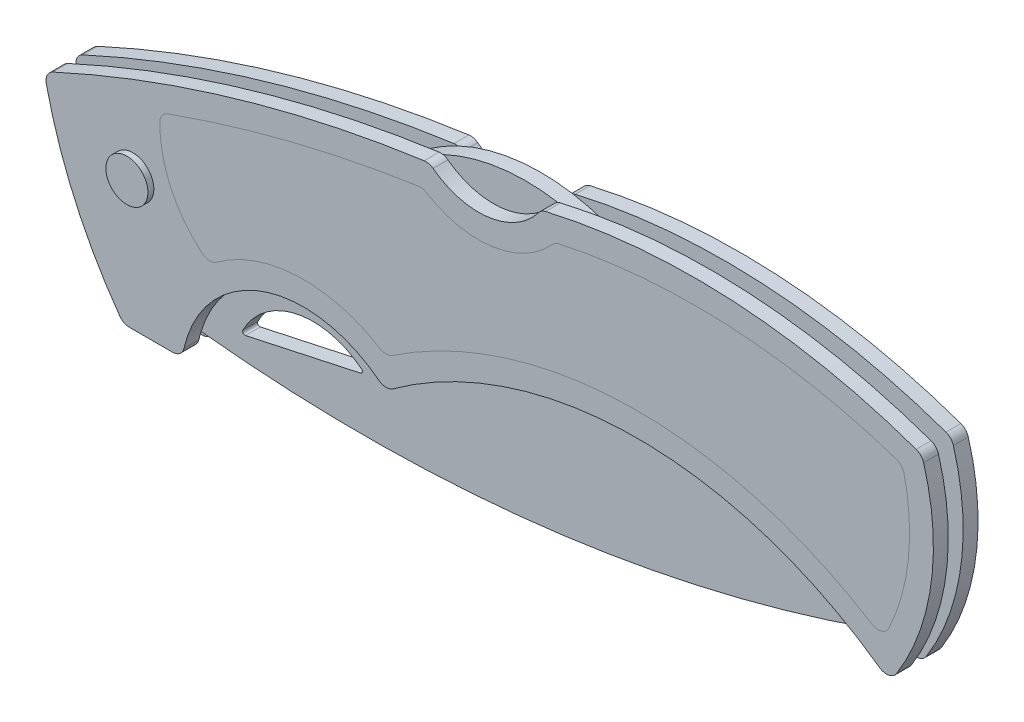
ISO-10303-21;
HEADER;
FILE_DESCRIPTION(('STEP AP214'),'2;1');
FILE_NAME('part.step','',(''),(''),'','','');
FILE_SCHEMA(('AUTOMOTIVE_DESIGN { 1 0 10303 214 1 1 1 1 }'));
ENDSEC;
DATA;
#1=APPLICATION_CONTEXT('core data for automotive mechanical design processes');
#2=APPLICATION_PROTOCOL_DEFINITION('international standard','automotive_design',2000,#1);
#3=PRODUCT_CONTEXT('',#1,'mechanical');
#4=PRODUCT('Part','Part','',(#3));
#5=PRODUCT_RELATED_PRODUCT_CATEGORY('part','',(#4));
#6=PRODUCT_DEFINITION_FORMATION('','',#4);
#7=PRODUCT_DEFINITION_CONTEXT('part definition',#1,'design');
#8=PRODUCT_DEFINITION('design','',#6,#7);
#9=PRODUCT_DEFINITION_SHAPE('','',#8);
#10=(LENGTH_UNIT() NAMED_UNIT(*) SI_UNIT(.MILLI.,.METRE.));
#11=(NAMED_UNIT(*) PLANE_ANGLE_UNIT() SI_UNIT($,.RADIAN.));
#12=(NAMED_UNIT(*) SI_UNIT($,.STERADIAN.) SOLID_ANGLE_UNIT());
#13=UNCERTAINTY_MEASURE_WITH_UNIT(LENGTH_MEASURE(1.E-05),#10,'distance_accuracy_value','');
#14=(GEOMETRIC_REPRESENTATION_CONTEXT(3) GLOBAL_UNCERTAINTY_ASSIGNED_CONTEXT((#13)) GLOBAL_UNIT_ASSIGNED_CONTEXT((#10,
#11,#12)) REPRESENTATION_CONTEXT('',''));
#15=CARTESIAN_POINT('',(0.,0.,0.));
#16=DIRECTION('',(0.,0.,1.));
#17=DIRECTION('',(1.,0.,0.));
#18=AXIS2_PLACEMENT_3D('',#15,#16,#17);
#19=CARTESIAN_POINT('',(-69.7760115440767,-14.4459744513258,9.525));
#20=DIRECTION('',(0.,0.,-1.));
#21=DIRECTION('',(1.,0.,0.));
#22=AXIS2_PLACEMENT_3D('',#19,#20,#21);
#23=PLANE('',#22);
#24=CARTESIAN_POINT('',(13.8488877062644,-82.1922508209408,9.525));
#25=DIRECTION('',(0.,0.,1.));
#26=DIRECTION('',(1.,0.,0.));
#27=AXIS2_PLACEMENT_3D('',#24,#25,#26);
#28=CIRCLE('',#27,140.987063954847);
#29=CARTESIAN_POINT('',(60.9015794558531,50.7114601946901,9.525));
#30=VERTEX_POINT('',#29);
#31=CARTESIAN_POINT('',(-18.170322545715,55.1107803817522,9.525));
#32=VERTEX_POINT('',#31);
#33=EDGE_CURVE('E427',#30,#32,#28,.T.);
#34=ORIENTED_EDGE('',*,*,#33,.T.);
#35=CARTESIAN_POINT('',(-17.5934696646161,52.6371513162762,9.525));
#36=DIRECTION('',(0.,0.,-1.));
#37=DIRECTION('',(-1.,0.,0.));
#38=AXIS2_PLACEMENT_3D('',#35,#36,#37);
#39=CIRCLE('',#38,2.54);
#40=CARTESIAN_POINT('',(-19.613358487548,54.1771672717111,9.525));
#41=VERTEX_POINT('',#40);
#42=EDGE_CURVE('E616',#32,#41,#39,.F.);
#43=ORIENTED_EDGE('',*,*,#42,.T.);
#44=CARTESIAN_POINT('',(-32.4473926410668,63.9621698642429,9.525));
#45=DIRECTION('',(0.,0.,-1.));
#46=DIRECTION('',(-1.,0.,0.));
#47=AXIS2_PLACEMENT_3D('',#44,#45,#46);
#48=CIRCLE('',#47,16.1387331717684);
#49=CARTESIAN_POINT('',(-42.1495672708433,51.0654060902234,9.525));
#50=VERTEX_POINT('',#49);
#51=EDGE_CURVE('E430',#41,#50,#48,.T.);
#52=ORIENTED_EDGE('',*,*,#51,.T.);
#53=CARTESIAN_POINT('',(-43.6765473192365,49.0356445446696,9.525));
#54=DIRECTION('',(0.,0.,-1.));
#55=DIRECTION('',(-1.,0.,0.));
#56=AXIS2_PLACEMENT_3D('',#53,#54,#55);
#57=CIRCLE('',#56,2.54);
#58=CARTESIAN_POINT('',(-44.0286660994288,51.551119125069,9.525));
#59=VERTEX_POINT('',#58);
#60=EDGE_CURVE('E614',#50,#59,#57,.F.);
#61=ORIENTED_EDGE('',*,*,#60,.T.);
#62=CARTESIAN_POINT('',(-4.71152292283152,-229.323630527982,9.525));
#63=DIRECTION('',(0.,0.,1.));
#64=DIRECTION('',(1.,0.,0.));
#65=AXIS2_PLACEMENT_3D('',#62,#63,#64);
#66=CIRCLE('',#65,283.613227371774);
#67=CARTESIAN_POINT('',(-123.229302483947,28.3389369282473,9.525));
#68=VERTEX_POINT('',#67);
#69=EDGE_CURVE('E433',#59,#68,#66,.T.);
#70=ORIENTED_EDGE('',*,*,#69,.T.);
#71=CARTESIAN_POINT('',(-122.167873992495,26.0313473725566,9.525));
#72=DIRECTION('',(0.,0.,-1.));
#73=DIRECTION('',(-1.,0.,0.));
#74=AXIS2_PLACEMENT_3D('',#71,#72,#73);
#75=CIRCLE('',#74,2.54);
#76=CARTESIAN_POINT('',(-124.647762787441,25.4820281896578,9.525));
#77=VERTEX_POINT('',#76);
#78=EDGE_CURVE('E608',#68,#77,#75,.F.);
#79=ORIENTED_EDGE('',*,*,#78,.T.);
#80=CARTESIAN_POINT('',(-31.1890758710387,46.1840248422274,9.525));
#81=DIRECTION('',(0.,0.,1.));
#82=DIRECTION('',(1.,0.,0.));
#83=AXIS2_PLACEMENT_3D('',#80,#81,#82);
#84=CIRCLE('',#83,95.7240765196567);
#85=CARTESIAN_POINT('',(-108.975071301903,-9.60520118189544,9.525));
#86=VERTEX_POINT('',#85);
#87=EDGE_CURVE('E436',#77,#86,#84,.T.);
#88=ORIENTED_EDGE('',*,*,#87,.T.);
#89=CARTESIAN_POINT('',(-106.911051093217,-8.12485643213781,9.525));
#90=DIRECTION('',(0.,0.,-1.));
#91=DIRECTION('',(-1.,0.,0.));
#92=AXIS2_PLACEMENT_3D('',#89,#90,#91);
#93=CIRCLE('',#92,2.54);
#94=CARTESIAN_POINT('',(-106.911051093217,-10.6648564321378,9.525));
#95=VERTEX_POINT('',#94);
#96=EDGE_CURVE('E602',#86,#95,#93,.F.);
#97=ORIENTED_EDGE('',*,*,#96,.T.);
#98=DIRECTION('',(1.,0.,0.));
#99=VECTOR('',#98,1.);
#100=CARTESIAN_POINT('',(-108.204032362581,-10.6648564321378,9.525));
#101=LINE('',#100,#99);
#102=CARTESIAN_POINT('',(-97.7363850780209,-10.6648564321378,9.525));
#103=VERTEX_POINT('',#102);
#104=EDGE_CURVE('E439',#95,#103,#101,.T.);
#105=ORIENTED_EDGE('',*,*,#104,.T.);
#106=CARTESIAN_POINT('',(-97.7363850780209,-8.12485643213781,9.525));
#107=DIRECTION('',(0.,0.,-1.));
#108=DIRECTION('',(-1.,0.,0.));
#109=AXIS2_PLACEMENT_3D('',#106,#107,#108);
#110=CIRCLE('',#109,2.54);
#111=CARTESIAN_POINT('',(-95.2589075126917,-8.68495009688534,9.525));
#112=VERTEX_POINT('',#111);
#113=EDGE_CURVE('E604',#103,#112,#110,.F.);
#114=ORIENTED_EDGE('',*,*,#113,.T.);
#115=CARTESIAN_POINT('',(-69.7760115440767,-14.4459744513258,9.525));
#116=DIRECTION('',(0.,0.,-1.));
#117=DIRECTION('',(1.,0.,0.));
#118=AXIS2_PLACEMENT_3D('',#115,#116,#117);
#119=CIRCLE('',#118,26.1259906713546);
#120=CARTESIAN_POINT('',(-53.7152238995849,6.1602985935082,9.525));
#121=VERTEX_POINT('',#120);
#122=EDGE_CURVE('E415',#112,#121,#119,.T.);
#123=ORIENTED_EDGE('',*,*,#122,.T.);
#124=CARTESIAN_POINT('',(-52.1537749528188,8.16366505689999,9.525));
#125=DIRECTION('',(0.,0.,-1.));
#126=DIRECTION('',(-1.,0.,0.));
#127=AXIS2_PLACEMENT_3D('',#124,#125,#126);
#128=CIRCLE('',#127,2.54);
#129=CARTESIAN_POINT('',(-50.6625731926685,6.10747505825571,9.525));
#130=VERTEX_POINT('',#129);
#131=EDGE_CURVE('E606',#121,#130,#128,.F.);
#132=ORIENTED_EDGE('',*,*,#131,.T.);
#133=CARTESIAN_POINT('',(1.47876712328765,-65.7892362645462,9.525));
#134=DIRECTION('',(0.,0.,-1.));
#135=DIRECTION('',(-1.,0.,0.));
#136=AXIS2_PLACEMENT_3D('',#133,#134,#135);
#137=CIRCLE('',#136,88.8136052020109);
#138=CARTESIAN_POINT('',(53.0914110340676,6.48794863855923,9.525));
#139=VERTEX_POINT('',#138);
#140=EDGE_CURVE('E418',#130,#139,#137,.T.);
#141=ORIENTED_EDGE('',*,*,#140,.T.);
#142=CARTESIAN_POINT('',(54.5674924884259,8.55501988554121,9.525));
#143=DIRECTION('',(0.,0.,-1.));
#144=DIRECTION('',(-1.,0.,0.));
#145=AXIS2_PLACEMENT_3D('',#142,#143,#144);
#146=CIRCLE('',#145,2.54);
#147=CARTESIAN_POINT('',(56.719843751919,7.20632272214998,9.525));
#148=VERTEX_POINT('',#147);
#149=EDGE_CURVE('E610',#139,#148,#146,.F.);
#150=ORIENTED_EDGE('',*,*,#149,.T.);
#151=CARTESIAN_POINT('',(13.1060009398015,34.5354427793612,9.525));
#152=DIRECTION('',(0.,0.,1.));
#153=DIRECTION('',(1.,0.,0.));
#154=AXIS2_PLACEMENT_3D('',#151,#152,#153);
#155=CIRCLE('',#154,51.4689040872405);
#156=CARTESIAN_POINT('',(62.49104703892,49.0325221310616,9.525));
#157=VERTEX_POINT('',#156);
#158=EDGE_CURVE('E424',#148,#157,#155,.T.);
#159=ORIENTED_EDGE('',*,*,#158,.T.);
#160=CARTESIAN_POINT('',(60.0538858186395,48.3170885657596,9.525));
#161=DIRECTION('',(0.,0.,-1.));
#162=DIRECTION('',(-1.,0.,0.));
#163=AXIS2_PLACEMENT_3D('',#160,#161,#162);
#164=CIRCLE('',#163,2.54);
#165=EDGE_CURVE('E612',#157,#30,#164,.F.);
#166=ORIENTED_EDGE('',*,*,#165,.T.);
#167=EDGE_LOOP('',(#34,#43,#52,#61,#70,#79,#88,#97,#105,#114,#123,#132,#141,#150,#159,#166));
#168=FACE_BOUND('',#167,.T.);
#169=CARTESIAN_POINT('',(-106.18343429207,17.4844215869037,9.525));
#170=DIRECTION('',(0.,0.,1.));
#171=DIRECTION('',(1.,0.,0.));
#172=AXIS2_PLACEMENT_3D('',#169,#170,#171);
#173=CIRCLE('',#172,4.48039023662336);
#174=CARTESIAN_POINT('',(-101.703044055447,17.4844215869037,9.525));
#175=VERTEX_POINT('',#174);
#176=EDGE_CURVE('E413',#175,#175,#173,.T.);
#177=ORIENTED_EDGE('',*,*,#176,.F.);
#178=EDGE_LOOP('',(#177));
#179=FACE_BOUND('',#178,.T.);
#180=CARTESIAN_POINT('',(-89.7836052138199,12.7291627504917,9.525));
#181=DIRECTION('',(0.,0.,-1.));
#182=DIRECTION('',(-1.,0.,0.));
#183=AXIS2_PLACEMENT_3D('',#180,#181,#182);
#184=CIRCLE('',#183,2.54);
#185=CARTESIAN_POINT('',(-91.4220120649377,10.7882292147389,9.525));
#186=VERTEX_POINT('',#185);
#187=CARTESIAN_POINT('',(-88.2776696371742,10.6837390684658,9.525));
#188=VERTEX_POINT('',#187);
#189=EDGE_CURVE('E12',#186,#188,#184,.F.);
#190=ORIENTED_EDGE('',*,*,#189,.F.);
#191=CARTESIAN_POINT('',(-75.0400400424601,30.1950809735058,9.525));
#192=DIRECTION('',(0.,0.,-1.));
#193=DIRECTION('',(-1.,0.,0.));
#194=AXIS2_PLACEMENT_3D('',#191,#192,#193);
#195=CIRCLE('',#194,25.3967498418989);
#196=CARTESIAN_POINT('',(-100.435045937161,30.4927017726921,9.525));
#197=VERTEX_POINT('',#196);
#198=EDGE_CURVE('E718',#197,#186,#195,.F.);
#199=ORIENTED_EDGE('',*,*,#198,.F.);
#200=CARTESIAN_POINT('',(-97.8952203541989,30.4629358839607,9.525));
#201=DIRECTION('',(0.,0.,-1.));
#202=DIRECTION('',(-1.,0.,0.));
#203=AXIS2_PLACEMENT_3D('',#200,#201,#202);
#204=CIRCLE('',#203,2.54);
#205=CARTESIAN_POINT('',(-98.7528015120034,32.8537839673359,9.525));
#206=VERTEX_POINT('',#205);
#207=EDGE_CURVE('E721',#206,#197,#204,.F.);
#208=ORIENTED_EDGE('',*,*,#207,.F.);
#209=CARTESIAN_POINT('',(-4.71152292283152,-229.323630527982,9.525));
#210=DIRECTION('',(0.,0.,-1.));
#211=DIRECTION('',(-1.,0.,0.));
#212=AXIS2_PLACEMENT_3D('',#209,#210,#211);
#213=CIRCLE('',#212,278.533227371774);
#214=CARTESIAN_POINT('',(-45.2693690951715,46.2409170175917,9.525));
#215=VERTEX_POINT('',#214);
#216=EDGE_CURVE('E724',#215,#206,#213,.F.);
#217=ORIENTED_EDGE('',*,*,#216,.F.);
#218=CARTESIAN_POINT('',(-44.8995140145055,43.727989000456,9.525));
#219=DIRECTION('',(0.,0.,-1.));
#220=DIRECTION('',(-1.,0.,0.));
#221=AXIS2_PLACEMENT_3D('',#218,#219,#220);
#222=CIRCLE('',#221,2.54);
#223=CARTESIAN_POINT('',(-43.5682819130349,45.8911859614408,9.525));
#224=VERTEX_POINT('',#223);
#225=EDGE_CURVE('E727',#224,#215,#222,.F.);
#226=ORIENTED_EDGE('',*,*,#225,.F.);
#227=CARTESIAN_POINT('',(-32.4473926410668,63.9621698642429,9.525));
#228=DIRECTION('',(0.,0.,-1.));
#229=DIRECTION('',(-1.,0.,0.));
#230=AXIS2_PLACEMENT_3D('',#227,#228,#229);
#231=CIRCLE('',#230,21.2187331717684);
#232=CARTESIAN_POINT('',(-16.6799404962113,49.7628005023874,9.525));
#233=VERTEX_POINT('',#232);
#234=EDGE_CURVE('E730',#233,#224,#231,.T.);
#235=ORIENTED_EDGE('',*,*,#234,.F.);
#236=CARTESIAN_POINT('',(-14.792489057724,48.0630572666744,9.525));
#237=DIRECTION('',(0.,0.,-1.));
#238=DIRECTION('',(-1.,0.,0.));
#239=AXIS2_PLACEMENT_3D('',#236,#237,#238);
#240=CIRCLE('',#239,2.54);
#241=CARTESIAN_POINT('',(-15.3379692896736,50.5437933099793,9.525));
#242=VERTEX_POINT('',#241);
#243=EDGE_CURVE('E733',#242,#233,#240,.F.);
#244=ORIENTED_EDGE('',*,*,#243,.F.);
#245=CARTESIAN_POINT('',(13.8488877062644,-82.1922508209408,9.525));
#246=DIRECTION('',(0.,0.,-1.));
#247=DIRECTION('',(-1.,0.,0.));
#248=AXIS2_PLACEMENT_3D('',#245,#246,#247);
#249=CIRCLE('',#248,135.907063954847);
#250=CARTESIAN_POINT('',(56.6317753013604,46.805247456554,9.525));
#251=VERTEX_POINT('',#250);
#252=EDGE_CURVE('E736',#251,#242,#249,.F.);
#253=ORIENTED_EDGE('',*,*,#252,.F.);
#254=CARTESIAN_POINT('',(55.8321955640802,44.3943820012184,9.525));
#255=DIRECTION('',(0.,0.,-1.));
#256=DIRECTION('',(-1.,0.,0.));
#257=AXIS2_PLACEMENT_3D('',#254,#255,#256);
#258=CIRCLE('',#257,2.54);
#259=CARTESIAN_POINT('',(58.3071612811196,44.9654727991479,9.525));
#260=VERTEX_POINT('',#259);
#261=EDGE_CURVE('E739',#260,#251,#258,.F.);
#262=ORIENTED_EDGE('',*,*,#261,.F.);
#263=CARTESIAN_POINT('',(13.1060009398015,34.5354427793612,9.525));
#264=DIRECTION('',(0.,0.,-1.));
#265=DIRECTION('',(-1.,0.,0.));
#266=AXIS2_PLACEMENT_3D('',#263,#264,#265);
#267=CIRCLE('',#266,46.3889040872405);
#268=CARTESIAN_POINT('',(55.0798372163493,14.7837975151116,9.525));
#269=VERTEX_POINT('',#268);
#270=EDGE_CURVE('E742',#269,#260,#267,.F.);
#271=ORIENTED_EDGE('',*,*,#270,.F.);
#272=CARTESIAN_POINT('',(52.781581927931,15.8652884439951,9.525));
#273=DIRECTION('',(0.,0.,-1.));
#274=DIRECTION('',(-1.,0.,0.));
#275=AXIS2_PLACEMENT_3D('',#272,#273,#274);
#276=CIRCLE('',#275,2.54);
#277=CARTESIAN_POINT('',(51.4302983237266,13.7145600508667,9.525));
#278=VERTEX_POINT('',#277);
#279=EDGE_CURVE('E745',#278,#269,#276,.F.);
#280=ORIENTED_EDGE('',*,*,#279,.F.);
#281=CARTESIAN_POINT('',(1.47876712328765,-65.7892362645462,9.525));
#282=DIRECTION('',(0.,0.,-1.));
#283=DIRECTION('',(-1.,0.,0.));
#284=AXIS2_PLACEMENT_3D('',#281,#282,#283);
#285=CIRCLE('',#284,93.8936052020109);
#286=CARTESIAN_POINT('',(-50.7570792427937,12.2327186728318,9.525));
#287=VERTEX_POINT('',#286);
#288=EDGE_CURVE('E748',#287,#278,#285,.T.);
#289=ORIENTED_EDGE('',*,*,#288,.F.);
#290=CARTESIAN_POINT('',(-52.1701579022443,14.3433604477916,9.525));
#291=DIRECTION('',(0.,0.,-1.));
#292=DIRECTION('',(-1.,0.,0.));
#293=AXIS2_PLACEMENT_3D('',#290,#291,#292);
#294=CIRCLE('',#293,2.54);
#295=CARTESIAN_POINT('',(-53.4953188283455,12.1764390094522,9.525));
#296=VERTEX_POINT('',#295);
#297=EDGE_CURVE('E751',#296,#287,#294,.F.);
#298=ORIENTED_EDGE('',*,*,#297,.F.);
#299=CARTESIAN_POINT('',(-69.7760115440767,-14.4459744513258,9.525));
#300=DIRECTION('',(0.,0.,-1.));
#301=DIRECTION('',(-1.,0.,0.));
#302=AXIS2_PLACEMENT_3D('',#299,#300,#301);
#303=CIRCLE('',#302,31.2059906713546);
#304=EDGE_CURVE('E50',#188,#296,#303,.T.);
#305=ORIENTED_EDGE('',*,*,#304,.F.);
#306=EDGE_LOOP('',(#190,#199,#208,#217,#226,#235,#244,#253,#262,#271,#280,#289,#298,#305));
#307=FACE_BOUND('',#306,.T.);
#308=ADVANCED_FACE('F41',(#168,#179,#307),#23,.F.);
#309=CARTESIAN_POINT('',(-69.7760115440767,-14.4459744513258,3.175));
#310=DIRECTION('',(0.,0.,1.));
#311=DIRECTION('',(1.,0.,0.));
#312=AXIS2_PLACEMENT_3D('',#309,#310,#311);
#313=PLANE('',#312);
#314=CARTESIAN_POINT('',(-106.18343429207,17.4844215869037,3.175));
#315=DIRECTION('',(0.,0.,1.));
#316=DIRECTION('',(1.,0.,0.));
#317=AXIS2_PLACEMENT_3D('',#314,#315,#316);
#318=CIRCLE('',#317,4.48039023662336);
#319=CARTESIAN_POINT('',(-101.703044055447,17.4844215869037,3.175));
#320=VERTEX_POINT('',#319);
#321=EDGE_CURVE('E500',#320,#320,#318,.T.);
#322=ORIENTED_EDGE('',*,*,#321,.F.);
#323=EDGE_LOOP('',(#322));
#324=FACE_BOUND('',#323,.T.);
#325=CARTESIAN_POINT('',(-25.5016111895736,14.0443009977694,3.175));
#326=DIRECTION('',(0.,0.,1.));
#327=DIRECTION('',(-1.,0.,0.));
#328=AXIS2_PLACEMENT_3D('',#325,#326,#327);
#329=CIRCLE('',#328,41.4552211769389);
#330=CARTESIAN_POINT('',(-43.2016962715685,51.5308632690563,3.175));
#331=VERTEX_POINT('',#330);
#332=CARTESIAN_POINT('',(-61.386257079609,34.8006868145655,3.175));
#333=VERTEX_POINT('',#332);
#334=EDGE_CURVE('E385',#331,#333,#329,.T.);
#335=ORIENTED_EDGE('',*,*,#334,.F.);
#336=CARTESIAN_POINT('',(-43.6765473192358,49.0356445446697,3.175));
#337=DIRECTION('',(0.,0.,1.));
#338=DIRECTION('',(1.,0.,0.));
#339=AXIS2_PLACEMENT_3D('',#336,#337,#338);
#340=CIRCLE('',#339,2.54);
#341=CARTESIAN_POINT('',(-44.0286660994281,51.5511191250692,3.175));
#342=VERTEX_POINT('',#341);
#343=EDGE_CURVE('E590',#331,#342,#340,.T.);
#344=ORIENTED_EDGE('',*,*,#343,.T.);
#345=CARTESIAN_POINT('',(-4.71152292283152,-229.323630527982,3.175));
#346=DIRECTION('',(0.,0.,1.));
#347=DIRECTION('',(1.,0.,0.));
#348=AXIS2_PLACEMENT_3D('',#345,#346,#347);
#349=CIRCLE('',#348,283.613227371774);
#350=CARTESIAN_POINT('',(-123.229302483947,28.3389369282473,3.175));
#351=VERTEX_POINT('',#350);
#352=EDGE_CURVE('E541',#342,#351,#349,.T.);
#353=ORIENTED_EDGE('',*,*,#352,.T.);
#354=CARTESIAN_POINT('',(-122.167873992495,26.0313473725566,3.175));
#355=DIRECTION('',(0.,0.,1.));
#356=DIRECTION('',(1.,0.,0.));
#357=AXIS2_PLACEMENT_3D('',#354,#355,#356);
#358=CIRCLE('',#357,2.54);
#359=CARTESIAN_POINT('',(-124.647762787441,25.4820281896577,3.175));
#360=VERTEX_POINT('',#359);
#361=EDGE_CURVE('E583',#351,#360,#358,.T.);
#362=ORIENTED_EDGE('',*,*,#361,.T.);
#363=CARTESIAN_POINT('',(-31.1890758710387,46.1840248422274,3.175));
#364=DIRECTION('',(0.,0.,1.));
#365=DIRECTION('',(1.,0.,0.));
#366=AXIS2_PLACEMENT_3D('',#363,#364,#365);
#367=CIRCLE('',#366,95.7240765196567);
#368=CARTESIAN_POINT('',(-108.975071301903,-9.60520118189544,3.175));
#369=VERTEX_POINT('',#368);
#370=EDGE_CURVE('E544',#360,#369,#367,.T.);
#371=ORIENTED_EDGE('',*,*,#370,.T.);
#372=CARTESIAN_POINT('',(-106.911051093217,-8.12485643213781,3.175));
#373=DIRECTION('',(0.,0.,1.));
#374=DIRECTION('',(1.,0.,0.));
#375=AXIS2_PLACEMENT_3D('',#372,#373,#374);
#376=CIRCLE('',#375,2.54);
#377=CARTESIAN_POINT('',(-106.911051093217,-10.6648564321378,3.175));
#378=VERTEX_POINT('',#377);
#379=EDGE_CURVE('E579',#369,#378,#376,.T.);
#380=ORIENTED_EDGE('',*,*,#379,.T.);
#381=DIRECTION('',(1.,0.,0.));
#382=VECTOR('',#381,1.);
#383=CARTESIAN_POINT('',(-108.204032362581,-10.6648564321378,3.175));
#384=LINE('',#383,#382);
#385=CARTESIAN_POINT('',(-97.7363850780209,-10.6648564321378,3.175));
#386=VERTEX_POINT('',#385);
#387=EDGE_CURVE('E547',#378,#386,#384,.T.);
#388=ORIENTED_EDGE('',*,*,#387,.T.);
#389=CARTESIAN_POINT('',(-97.7363850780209,-8.12485643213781,3.175));
#390=DIRECTION('',(0.,0.,1.));
#391=DIRECTION('',(1.,0.,0.));
#392=AXIS2_PLACEMENT_3D('',#389,#390,#391);
#393=CIRCLE('',#392,2.54);
#394=CARTESIAN_POINT('',(-95.2589075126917,-8.68495009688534,3.175));
#395=VERTEX_POINT('',#394);
#396=EDGE_CURVE('E581',#386,#395,#393,.T.);
#397=ORIENTED_EDGE('',*,*,#396,.T.);
#398=CARTESIAN_POINT('',(-69.7760115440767,-14.4459744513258,3.175));
#399=DIRECTION('',(0.,0.,-1.));
#400=DIRECTION('',(1.,0.,0.));
#401=AXIS2_PLACEMENT_3D('',#398,#399,#400);
#402=CIRCLE('',#401,26.1259906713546);
#403=CARTESIAN_POINT('',(-94.8013641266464,-6.94270072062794,3.175));
#404=VERTEX_POINT('',#403);
#405=EDGE_CURVE('E527',#395,#404,#402,.T.);
#406=ORIENTED_EDGE('',*,*,#405,.T.);
#407=CARTESIAN_POINT('',(-60.1382672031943,318.104738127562,3.175));
#408=DIRECTION('',(0.,0.,1.));
#409=DIRECTION('',(1.,0.,0.));
#410=AXIS2_PLACEMENT_3D('',#407,#408,#409);
#411=CIRCLE('',#410,326.890452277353);
#412=CARTESIAN_POINT('',(-105.485949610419,-5.62501875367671,3.175));
#413=VERTEX_POINT('',#412);
#414=EDGE_CURVE('E482',#413,#404,#411,.T.);
#415=ORIENTED_EDGE('',*,*,#414,.F.);
#416=CARTESIAN_POINT('',(-15.0778395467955,-77.1571378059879,3.175));
#417=DIRECTION('',(0.,0.,1.));
#418=DIRECTION('',(-1.,0.,0.));
#419=AXIS2_PLACEMENT_3D('',#416,#417,#418);
#420=CIRCLE('',#419,115.284302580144);
#421=CARTESIAN_POINT('',(56.9101857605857,12.8883764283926,3.175));
#422=VERTEX_POINT('',#421);
#423=EDGE_CURVE('E478',#422,#413,#420,.T.);
#424=ORIENTED_EDGE('',*,*,#423,.F.);
#425=CARTESIAN_POINT('',(48.2545847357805,9.70830909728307,3.175));
#426=VERTEX_POINT('',#425);
#427=EDGE_CURVE('E486',#426,#422,#411,.T.);
#428=ORIENTED_EDGE('',*,*,#427,.F.);
#429=CARTESIAN_POINT('',(1.47876712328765,-65.7892362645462,3.175));
#430=DIRECTION('',(0.,0.,-1.));
#431=DIRECTION('',(-1.,0.,0.));
#432=AXIS2_PLACEMENT_3D('',#429,#430,#431);
#433=CIRCLE('',#432,88.8136052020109);
#434=CARTESIAN_POINT('',(53.0914110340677,6.48794863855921,3.175));
#435=VERTEX_POINT('',#434);
#436=EDGE_CURVE('E529',#426,#435,#433,.T.);
#437=ORIENTED_EDGE('',*,*,#436,.T.);
#438=CARTESIAN_POINT('',(54.5674924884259,8.55501988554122,3.175));
#439=DIRECTION('',(0.,0.,1.));
#440=DIRECTION('',(1.,0.,0.));
#441=AXIS2_PLACEMENT_3D('',#438,#439,#440);
#442=CIRCLE('',#441,2.54);
#443=CARTESIAN_POINT('',(56.719843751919,7.20632272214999,3.175));
#444=VERTEX_POINT('',#443);
#445=EDGE_CURVE('E585',#435,#444,#442,.T.);
#446=ORIENTED_EDGE('',*,*,#445,.T.);
#447=CARTESIAN_POINT('',(13.1060009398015,34.5354427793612,3.175));
#448=DIRECTION('',(0.,0.,1.));
#449=DIRECTION('',(1.,0.,0.));
#450=AXIS2_PLACEMENT_3D('',#447,#448,#449);
#451=CIRCLE('',#450,51.4689040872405);
#452=CARTESIAN_POINT('',(62.49104703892,49.0325221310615,3.175));
#453=VERTEX_POINT('',#452);
#454=EDGE_CURVE('E533',#444,#453,#451,.T.);
#455=ORIENTED_EDGE('',*,*,#454,.T.);
#456=CARTESIAN_POINT('',(60.0538858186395,48.3170885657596,3.175));
#457=DIRECTION('',(0.,0.,1.));
#458=DIRECTION('',(1.,0.,0.));
#459=AXIS2_PLACEMENT_3D('',#456,#457,#458);
#460=CIRCLE('',#459,2.54);
#461=CARTESIAN_POINT('',(60.9015794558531,50.7114601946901,3.175));
#462=VERTEX_POINT('',#461);
#463=EDGE_CURVE('E587',#453,#462,#460,.T.);
#464=ORIENTED_EDGE('',*,*,#463,.T.);
#465=CARTESIAN_POINT('',(13.8488877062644,-82.1922508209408,3.175));
#466=DIRECTION('',(0.,0.,1.));
#467=DIRECTION('',(1.,0.,0.));
#468=AXIS2_PLACEMENT_3D('',#465,#466,#467);
#469=CIRCLE('',#468,140.987063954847);
#470=CARTESIAN_POINT('',(-18.1703225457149,55.1107803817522,3.175));
#471=VERTEX_POINT('',#470);
#472=EDGE_CURVE('E536',#462,#471,#469,.T.);
#473=ORIENTED_EDGE('',*,*,#472,.T.);
#474=CARTESIAN_POINT('',(-17.593469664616,52.6371513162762,3.175));
#475=DIRECTION('',(0.,0.,1.));
#476=DIRECTION('',(1.,0.,0.));
#477=AXIS2_PLACEMENT_3D('',#474,#475,#476);
#478=CIRCLE('',#477,2.54);
#479=CARTESIAN_POINT('',(-18.6778403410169,54.9340492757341,3.175));
#480=VERTEX_POINT('',#479);
#481=EDGE_CURVE('E382',#471,#480,#478,.T.);
#482=ORIENTED_EDGE('',*,*,#481,.T.);
#483=CARTESIAN_POINT('',(3.31150879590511,43.8493253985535,3.175));
#484=VERTEX_POINT('',#483);
#485=EDGE_CURVE('E368',#484,#480,#329,.T.);
#486=ORIENTED_EDGE('',*,*,#485,.F.);
#487=DIRECTION('',(0.990360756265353,0.138511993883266,0.));
#488=VECTOR('',#487,1.);
#489=CARTESIAN_POINT('',(-61.386257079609,34.8006868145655,3.175));
#490=LINE('',#489,#488);
#491=EDGE_CURVE('E356',#333,#484,#490,.T.);
#492=ORIENTED_EDGE('',*,*,#491,.F.);
#493=EDGE_LOOP('',(#335,#344,#353,#362,#371,#380,#388,#397,#406,#415,#424,#428,#437,#446,#455,
#464,#473,#482,#486,#492));
#494=FACE_BOUND('',#493,.T.);
#495=ADVANCED_FACE('F379',(#324,#494),#313,.T.);
#496=CARTESIAN_POINT('',(-69.7760115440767,-14.4459744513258,6.35));
#497=DIRECTION('',(0.,0.,-1.));
#498=DIRECTION('',(1.,0.,0.));
#499=AXIS2_PLACEMENT_3D('',#496,#497,#498);
#500=PLANE('',#499);
#501=CARTESIAN_POINT('',(-106.18343429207,17.4844215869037,6.35));
#502=DIRECTION('',(0.,0.,-1.));
#503=DIRECTION('',(-1.,0.,0.));
#504=AXIS2_PLACEMENT_3D('',#501,#502,#503);
#505=CIRCLE('',#504,4.48039023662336);
#506=CARTESIAN_POINT('',(-110.663824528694,17.4844215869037,6.35));
#507=VERTEX_POINT('',#506);
#508=EDGE_CURVE('E387',#507,#507,#505,.T.);
#509=ORIENTED_EDGE('',*,*,#508,.F.);
#510=EDGE_LOOP('',(#509));
#511=FACE_BOUND('',#510,.T.);
#512=CARTESIAN_POINT('',(-25.5016111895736,14.0443009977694,6.35));
#513=DIRECTION('',(0.,0.,1.));
#514=DIRECTION('',(-1.,0.,0.));
#515=AXIS2_PLACEMENT_3D('',#512,#513,#514);
#516=CIRCLE('',#515,41.4552211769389);
#517=CARTESIAN_POINT('',(3.31150879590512,43.8493253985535,6.35));
#518=VERTEX_POINT('',#517);
#519=CARTESIAN_POINT('',(-18.6778403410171,54.9340492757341,6.35));
#520=VERTEX_POINT('',#519);
#521=EDGE_CURVE('E375',#518,#520,#516,.T.);
#522=ORIENTED_EDGE('',*,*,#521,.T.);
#523=CARTESIAN_POINT('',(-17.5934696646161,52.6371513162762,6.35));
#524=DIRECTION('',(0.,0.,-1.));
#525=DIRECTION('',(-1.,0.,0.));
#526=AXIS2_PLACEMENT_3D('',#523,#524,#525);
#527=CIRCLE('',#526,2.54);
#528=CARTESIAN_POINT('',(-18.170322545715,55.1107803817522,6.35));
#529=VERTEX_POINT('',#528);
#530=EDGE_CURVE('E636',#520,#529,#527,.T.);
#531=ORIENTED_EDGE('',*,*,#530,.T.);
#532=CARTESIAN_POINT('',(13.8488877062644,-82.1922508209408,6.35));
#533=DIRECTION('',(0.,0.,1.));
#534=DIRECTION('',(1.,0.,0.));
#535=AXIS2_PLACEMENT_3D('',#532,#533,#534);
#536=CIRCLE('',#535,140.987063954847);
#537=CARTESIAN_POINT('',(60.9015794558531,50.7114601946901,6.35));
#538=VERTEX_POINT('',#537);
#539=EDGE_CURVE('E451',#538,#529,#536,.T.);
#540=ORIENTED_EDGE('',*,*,#539,.F.);
#541=CARTESIAN_POINT('',(60.0538858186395,48.3170885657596,6.35));
#542=DIRECTION('',(0.,0.,-1.));
#543=DIRECTION('',(-1.,0.,0.));
#544=AXIS2_PLACEMENT_3D('',#541,#542,#543);
#545=CIRCLE('',#544,2.54);
#546=CARTESIAN_POINT('',(62.49104703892,49.0325221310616,6.35));
#547=VERTEX_POINT('',#546);
#548=EDGE_CURVE('E631',#538,#547,#545,.T.);
#549=ORIENTED_EDGE('',*,*,#548,.T.);
#550=CARTESIAN_POINT('',(13.1060009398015,34.5354427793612,6.35));
#551=DIRECTION('',(0.,0.,1.));
#552=DIRECTION('',(1.,0.,0.));
#553=AXIS2_PLACEMENT_3D('',#550,#551,#552);
#554=CIRCLE('',#553,51.4689040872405);
#555=CARTESIAN_POINT('',(56.719843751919,7.20632272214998,6.35));
#556=VERTEX_POINT('',#555);
#557=EDGE_CURVE('E448',#556,#547,#554,.T.);
#558=ORIENTED_EDGE('',*,*,#557,.F.);
#559=CARTESIAN_POINT('',(54.5674924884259,8.55501988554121,6.35));
#560=DIRECTION('',(0.,0.,-1.));
#561=DIRECTION('',(-1.,0.,0.));
#562=AXIS2_PLACEMENT_3D('',#559,#560,#561);
#563=CIRCLE('',#562,2.54);
#564=CARTESIAN_POINT('',(53.0914110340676,6.48794863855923,6.35));
#565=VERTEX_POINT('',#564);
#566=EDGE_CURVE('E629',#556,#565,#563,.T.);
#567=ORIENTED_EDGE('',*,*,#566,.T.);
#568=CARTESIAN_POINT('',(1.47876712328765,-65.7892362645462,6.35));
#569=DIRECTION('',(0.,0.,-1.));
#570=DIRECTION('',(-1.,0.,0.));
#571=AXIS2_PLACEMENT_3D('',#568,#569,#570);
#572=CIRCLE('',#571,88.8136052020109);
#573=CARTESIAN_POINT('',(48.2545847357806,9.70830909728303,6.35));
#574=VERTEX_POINT('',#573);
#575=EDGE_CURVE('E444',#574,#565,#572,.T.);
#576=ORIENTED_EDGE('',*,*,#575,.F.);
#577=CARTESIAN_POINT('',(-60.1382672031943,318.104738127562,6.35));
#578=DIRECTION('',(0.,0.,1.));
#579=DIRECTION('',(1.,0.,0.));
#580=AXIS2_PLACEMENT_3D('',#577,#578,#579);
#581=CIRCLE('',#580,326.890452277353);
#582=CARTESIAN_POINT('',(56.9101857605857,12.8883764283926,6.35));
#583=VERTEX_POINT('',#582);
#584=EDGE_CURVE('E489',#574,#583,#581,.T.);
#585=ORIENTED_EDGE('',*,*,#584,.T.);
#586=CARTESIAN_POINT('',(-15.0778395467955,-77.1571378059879,6.35));
#587=DIRECTION('',(0.,0.,1.));
#588=DIRECTION('',(-1.,0.,0.));
#589=AXIS2_PLACEMENT_3D('',#586,#587,#588);
#590=CIRCLE('',#589,115.284302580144);
#591=CARTESIAN_POINT('',(-105.485949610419,-5.62501875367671,6.35));
#592=VERTEX_POINT('',#591);
#593=EDGE_CURVE('E485',#583,#592,#590,.T.);
#594=ORIENTED_EDGE('',*,*,#593,.T.);
#595=CARTESIAN_POINT('',(-94.8013641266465,-6.94270072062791,6.35));
#596=VERTEX_POINT('',#595);
#597=EDGE_CURVE('E490',#592,#596,#581,.T.);
#598=ORIENTED_EDGE('',*,*,#597,.T.);
#599=CARTESIAN_POINT('',(-69.7760115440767,-14.4459744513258,6.35));
#600=DIRECTION('',(0.,0.,-1.));
#601=DIRECTION('',(1.,0.,0.));
#602=AXIS2_PLACEMENT_3D('',#599,#600,#601);
#603=CIRCLE('',#602,26.1259906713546);
#604=CARTESIAN_POINT('',(-95.2589075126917,-8.68495009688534,6.35));
#605=VERTEX_POINT('',#604);
#606=EDGE_CURVE('E442',#605,#596,#603,.T.);
#607=ORIENTED_EDGE('',*,*,#606,.F.);
#608=CARTESIAN_POINT('',(-97.7363850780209,-8.12485643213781,6.35));
#609=DIRECTION('',(0.,0.,-1.));
#610=DIRECTION('',(-1.,0.,0.));
#611=AXIS2_PLACEMENT_3D('',#608,#609,#610);
#612=CIRCLE('',#611,2.54);
#613=CARTESIAN_POINT('',(-97.7363850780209,-10.6648564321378,6.35));
#614=VERTEX_POINT('',#613);
#615=EDGE_CURVE('E625',#605,#614,#612,.T.);
#616=ORIENTED_EDGE('',*,*,#615,.T.);
#617=DIRECTION('',(1.,0.,0.));
#618=VECTOR('',#617,1.);
#619=CARTESIAN_POINT('',(-108.204032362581,-10.6648564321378,6.35));
#620=LINE('',#619,#618);
#621=CARTESIAN_POINT('',(-106.911051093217,-10.6648564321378,6.35));
#622=VERTEX_POINT('',#621);
#623=EDGE_CURVE('E463',#622,#614,#620,.T.);
#624=ORIENTED_EDGE('',*,*,#623,.F.);
#625=CARTESIAN_POINT('',(-106.911051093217,-8.12485643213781,6.35));
#626=DIRECTION('',(0.,0.,-1.));
#627=DIRECTION('',(-1.,0.,0.));
#628=AXIS2_PLACEMENT_3D('',#625,#626,#627);
#629=CIRCLE('',#628,2.54);
#630=CARTESIAN_POINT('',(-108.975071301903,-9.60520118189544,6.35));
#631=VERTEX_POINT('',#630);
#632=EDGE_CURVE('E623',#622,#631,#629,.T.);
#633=ORIENTED_EDGE('',*,*,#632,.T.);
#634=CARTESIAN_POINT('',(-31.1890758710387,46.1840248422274,6.35));
#635=DIRECTION('',(0.,0.,1.));
#636=DIRECTION('',(1.,0.,0.));
#637=AXIS2_PLACEMENT_3D('',#634,#635,#636);
#638=CIRCLE('',#637,95.7240765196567);
#639=CARTESIAN_POINT('',(-124.647762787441,25.4820281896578,6.35));
#640=VERTEX_POINT('',#639);
#641=EDGE_CURVE('E460',#640,#631,#638,.T.);
#642=ORIENTED_EDGE('',*,*,#641,.F.);
#643=CARTESIAN_POINT('',(-122.167873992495,26.0313473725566,6.35));
#644=DIRECTION('',(0.,0.,-1.));
#645=DIRECTION('',(-1.,0.,0.));
#646=AXIS2_PLACEMENT_3D('',#643,#644,#645);
#647=CIRCLE('',#646,2.54);
#648=CARTESIAN_POINT('',(-123.229302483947,28.3389369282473,6.35));
#649=VERTEX_POINT('',#648);
#650=EDGE_CURVE('E627',#640,#649,#647,.T.);
#651=ORIENTED_EDGE('',*,*,#650,.T.);
#652=CARTESIAN_POINT('',(-4.71152292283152,-229.323630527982,6.35));
#653=DIRECTION('',(0.,0.,1.));
#654=DIRECTION('',(1.,0.,0.));
#655=AXIS2_PLACEMENT_3D('',#652,#653,#654);
#656=CIRCLE('',#655,283.613227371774);
#657=CARTESIAN_POINT('',(-44.0286660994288,51.551119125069,6.35));
#658=VERTEX_POINT('',#657);
#659=EDGE_CURVE('E457',#658,#649,#656,.T.);
#660=ORIENTED_EDGE('',*,*,#659,.F.);
#661=CARTESIAN_POINT('',(-43.6765473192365,49.0356445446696,6.35));
#662=DIRECTION('',(0.,0.,-1.));
#663=DIRECTION('',(-1.,0.,0.));
#664=AXIS2_PLACEMENT_3D('',#661,#662,#663);
#665=CIRCLE('',#664,2.54);
#666=CARTESIAN_POINT('',(-43.2016962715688,51.5308632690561,6.35));
#667=VERTEX_POINT('',#666);
#668=EDGE_CURVE('E633',#658,#667,#665,.T.);
#669=ORIENTED_EDGE('',*,*,#668,.T.);
#670=CARTESIAN_POINT('',(-25.5016111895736,14.0443009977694,6.35));
#671=DIRECTION('',(0.,0.,-1.));
#672=DIRECTION('',(-1.,0.,0.));
#673=AXIS2_PLACEMENT_3D('',#670,#671,#672);
#674=CIRCLE('',#673,41.4552211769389);
#675=CARTESIAN_POINT('',(-61.386257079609,34.8006868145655,6.35));
#676=VERTEX_POINT('',#675);
#677=EDGE_CURVE('E553',#667,#676,#674,.F.);
#678=ORIENTED_EDGE('',*,*,#677,.T.);
#679=DIRECTION('',(0.990360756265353,0.138511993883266,0.));
#680=VECTOR('',#679,1.);
#681=CARTESIAN_POINT('',(-61.386257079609,34.8006868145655,6.35));
#682=LINE('',#681,#680);
#683=EDGE_CURVE('E376',#676,#518,#682,.T.);
#684=ORIENTED_EDGE('',*,*,#683,.T.);
#685=EDGE_LOOP('',(#522,#531,#540,#549,#558,#567,#576,#585,#594,#598,#607,#616,#624,#633,#642,
#651,#660,#669,#678,#684));
#686=FACE_BOUND('',#685,.T.);
#687=ADVANCED_FACE('F801',(#511,#686),#500,.T.);
#688=CARTESIAN_POINT('',(-37.6080533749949,120.473800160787,6.35));
#689=DIRECTION('',(0.,0.,-1.));
#690=DIRECTION('',(-1.,0.,0.));
#691=AXIS2_PLACEMENT_3D('',#688,#689,#690);
#692=PLANE('',#691);
#693=CARTESIAN_POINT('',(-70.9635931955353,-9.9820805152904,6.35));
#694=DIRECTION('',(0.,0.,1.));
#695=DIRECTION('',(-1.,0.,0.));
#696=AXIS2_PLACEMENT_3D('',#693,#694,#695);
#697=CIRCLE('',#696,16.8159295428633);
#698=CARTESIAN_POINT('',(-60.5828506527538,3.24726832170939,6.35));
#699=VERTEX_POINT('',#698);
#700=CARTESIAN_POINT('',(-85.8920375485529,-2.24147100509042,6.35));
#701=VERTEX_POINT('',#700);
#702=EDGE_CURVE('E472',#699,#701,#697,.T.);
#703=ORIENTED_EDGE('',*,*,#702,.F.);
#704=CARTESIAN_POINT('',(-60.8964471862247,2.84761695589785,6.35));
#705=DIRECTION('',(0.,0.,-1.));
#706=DIRECTION('',(-1.,0.,0.));
#707=AXIS2_PLACEMENT_3D('',#704,#705,#706);
#708=CIRCLE('',#707,0.508);
#709=CARTESIAN_POINT('',(-60.7887812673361,2.35115744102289,6.35));
#710=VERTEX_POINT('',#709);
#711=EDGE_CURVE('E712',#699,#710,#708,.T.);
#712=ORIENTED_EDGE('',*,*,#711,.T.);
#713=DIRECTION('',(0.977282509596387,0.211940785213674,0.));
#714=VECTOR('',#713,1.);
#715=CARTESIAN_POINT('',(-86.3475572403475,-3.1917096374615,6.35));
#716=LINE('',#715,#714);
#717=CARTESIAN_POINT('',(-85.3333915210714,-2.97177008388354,6.35));
#718=VERTEX_POINT('',#717);
#719=EDGE_CURVE('E475',#718,#710,#716,.T.);
#720=ORIENTED_EDGE('',*,*,#719,.F.);
#721=CARTESIAN_POINT('',(-85.4410574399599,-2.47531056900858,6.35));
#722=DIRECTION('',(0.,0.,-1.));
#723=DIRECTION('',(-1.,0.,0.));
#724=AXIS2_PLACEMENT_3D('',#721,#722,#723);
#725=CIRCLE('',#724,0.508);
#726=EDGE_CURVE('E716',#718,#701,#725,.T.);
#727=ORIENTED_EDGE('',*,*,#726,.T.);
#728=EDGE_LOOP('',(#703,#712,#720,#727));
#729=FACE_BOUND('',#728,.T.);
#730=CARTESIAN_POINT('',(-53.7152238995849,6.1602985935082,6.35));
#731=VERTEX_POINT('',#730);
#732=EDGE_CURVE('E445',#596,#731,#603,.T.);
#733=ORIENTED_EDGE('',*,*,#732,.F.);
#734=EDGE_CURVE('E494',#596,#574,#581,.T.);
#735=ORIENTED_EDGE('',*,*,#734,.T.);
#736=CARTESIAN_POINT('',(-50.6625731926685,6.10747505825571,6.35));
#737=VERTEX_POINT('',#736);
#738=EDGE_CURVE('E446',#737,#574,#572,.T.);
#739=ORIENTED_EDGE('',*,*,#738,.F.);
#740=CARTESIAN_POINT('',(-52.1537749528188,8.16366505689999,6.35));
#741=DIRECTION('',(0.,0.,-1.));
#742=DIRECTION('',(-1.,0.,0.));
#743=AXIS2_PLACEMENT_3D('',#740,#741,#742);
#744=CIRCLE('',#743,2.54);
#745=EDGE_CURVE('E698',#737,#731,#744,.T.);
#746=ORIENTED_EDGE('',*,*,#745,.T.);
#747=EDGE_LOOP('',(#733,#735,#739,#746));
#748=FACE_BOUND('',#747,.T.);
#749=ADVANCED_FACE('F864',(#729,#748),#692,.F.);
#750=CARTESIAN_POINT('',(-69.7760115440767,-14.4459744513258,3.175));
#751=DIRECTION('',(0.,0.,-1.));
#752=DIRECTION('',(-1.,0.,0.));
#753=AXIS2_PLACEMENT_3D('',#750,#751,#752);
#754=CYLINDRICAL_SURFACE('',#753,26.1259906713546);
#755=ORIENTED_EDGE('',*,*,#405,.F.);
#756=DIRECTION('',(0.,0.,-1.));
#757=VECTOR('',#756,1.);
#758=CARTESIAN_POINT('',(-95.2589075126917,-8.68495009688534,3.175));
#759=LINE('',#758,#757);
#760=CARTESIAN_POINT('',(-95.2589075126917,-8.68495009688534,0.));
#761=VERTEX_POINT('',#760);
#762=EDGE_CURVE('E680',#395,#761,#759,.T.);
#763=ORIENTED_EDGE('',*,*,#762,.T.);
#764=CARTESIAN_POINT('',(-69.7760115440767,-14.4459744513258,0.));
#765=DIRECTION('',(0.,0.,-1.));
#766=DIRECTION('',(1.,0.,0.));
#767=AXIS2_PLACEMENT_3D('',#764,#765,#766);
#768=CIRCLE('',#767,26.1259906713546);
#769=CARTESIAN_POINT('',(-52.2497716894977,4.92922374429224,0.));
#770=VERTEX_POINT('',#769);
#771=EDGE_CURVE('E503',#761,#770,#768,.T.);
#772=ORIENTED_EDGE('',*,*,#771,.T.);
#773=DIRECTION('',(0.,0.,-1.));
#774=VECTOR('',#773,1.);
#775=CARTESIAN_POINT('',(-52.2497716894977,4.92922374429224,3.175));
#776=LINE('',#775,#774);
#777=CARTESIAN_POINT('',(-52.2497716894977,4.92922374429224,3.175));
#778=VERTEX_POINT('',#777);
#779=EDGE_CURVE('E550',#778,#770,#776,.T.);
#780=ORIENTED_EDGE('',*,*,#779,.F.);
#781=EDGE_CURVE('E526',#404,#778,#402,.T.);
#782=ORIENTED_EDGE('',*,*,#781,.F.);
#783=EDGE_LOOP('',(#755,#763,#772,#780,#782));
#784=FACE_BOUND('',#783,.T.);
#785=ADVANCED_FACE('F43',(#784),#754,.F.);
#786=CARTESIAN_POINT('',(1.47876712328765,-65.7892362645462,3.175));
#787=DIRECTION('',(0.,0.,-1.));
#788=DIRECTION('',(-1.,0.,0.));
#789=AXIS2_PLACEMENT_3D('',#786,#787,#788);
#790=CYLINDRICAL_SURFACE('',#789,88.8136052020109);
#791=CARTESIAN_POINT('',(1.47876712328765,-65.7892362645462,0.));
#792=DIRECTION('',(0.,0.,-1.));
#793=DIRECTION('',(-1.,0.,0.));
#794=AXIS2_PLACEMENT_3D('',#791,#792,#793);
#795=CIRCLE('',#794,88.8136052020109);
#796=CARTESIAN_POINT('',(53.0914110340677,6.48794863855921,0.));
#797=VERTEX_POINT('',#796);
#798=EDGE_CURVE('E505',#770,#797,#795,.T.);
#799=ORIENTED_EDGE('',*,*,#798,.T.);
#800=DIRECTION('',(0.,0.,-1.));
#801=VECTOR('',#800,1.);
#802=CARTESIAN_POINT('',(53.0914110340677,6.48794863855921,3.175));
#803=LINE('',#802,#801);
#804=EDGE_CURVE('E658',#797,#435,#803,.F.);
#805=ORIENTED_EDGE('',*,*,#804,.T.);
#806=ORIENTED_EDGE('',*,*,#436,.F.);
#807=EDGE_CURVE('E530',#778,#426,#433,.T.);
#808=ORIENTED_EDGE('',*,*,#807,.F.);
#809=ORIENTED_EDGE('',*,*,#779,.T.);
#810=EDGE_LOOP('',(#799,#805,#806,#808,#809));
#811=FACE_BOUND('',#810,.T.);
#812=ADVANCED_FACE('F899',(#811),#790,.F.);
#813=CARTESIAN_POINT('',(13.1060009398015,34.5354427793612,3.175));
#814=DIRECTION('',(0.,0.,-1.));
#815=DIRECTION('',(-1.,0.,0.));
#816=AXIS2_PLACEMENT_3D('',#813,#814,#815);
#817=CYLINDRICAL_SURFACE('',#816,51.4689040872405);
#818=CARTESIAN_POINT('',(13.1060009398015,34.5354427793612,0.));
#819=DIRECTION('',(0.,0.,1.));
#820=DIRECTION('',(1.,0.,0.));
#821=AXIS2_PLACEMENT_3D('',#818,#819,#820);
#822=CIRCLE('',#821,51.4689040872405);
#823=CARTESIAN_POINT('',(56.719843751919,7.20632272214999,0.));
#824=VERTEX_POINT('',#823);
#825=CARTESIAN_POINT('',(62.49104703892,49.0325221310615,0.));
#826=VERTEX_POINT('',#825);
#827=EDGE_CURVE('E508',#824,#826,#822,.T.);
#828=ORIENTED_EDGE('',*,*,#827,.T.);
#829=DIRECTION('',(0.,0.,-1.));
#830=VECTOR('',#829,1.);
#831=CARTESIAN_POINT('',(62.49104703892,49.0325221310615,3.175));
#832=LINE('',#831,#830);
#833=EDGE_CURVE('E646',#826,#453,#832,.F.);
#834=ORIENTED_EDGE('',*,*,#833,.T.);
#835=ORIENTED_EDGE('',*,*,#454,.F.);
#836=DIRECTION('',(0.,0.,-1.));
#837=VECTOR('',#836,1.);
#838=CARTESIAN_POINT('',(56.719843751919,7.20632272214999,3.175));
#839=LINE('',#838,#837);
#840=EDGE_CURVE('E643',#444,#824,#839,.T.);
#841=ORIENTED_EDGE('',*,*,#840,.T.);
#842=EDGE_LOOP('',(#828,#834,#835,#841));
#843=FACE_BOUND('',#842,.T.);
#844=ADVANCED_FACE('F896',(#843),#817,.T.);
#845=CARTESIAN_POINT('',(13.8488877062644,-82.1922508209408,3.175));
#846=DIRECTION('',(0.,0.,-1.));
#847=DIRECTION('',(-1.,0.,0.));
#848=AXIS2_PLACEMENT_3D('',#845,#846,#847);
#849=CYLINDRICAL_SURFACE('',#848,140.987063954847);
#850=CARTESIAN_POINT('',(13.8488877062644,-82.1922508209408,0.));
#851=DIRECTION('',(0.,0.,1.));
#852=DIRECTION('',(1.,0.,0.));
#853=AXIS2_PLACEMENT_3D('',#850,#851,#852);
#854=CIRCLE('',#853,140.987063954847);
#855=CARTESIAN_POINT('',(60.9015794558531,50.7114601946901,0.));
#856=VERTEX_POINT('',#855);
#857=CARTESIAN_POINT('',(-18.1703225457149,55.1107803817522,0.));
#858=VERTEX_POINT('',#857);
#859=EDGE_CURVE('E511',#856,#858,#854,.T.);
#860=ORIENTED_EDGE('',*,*,#859,.T.);
#861=DIRECTION('',(0.,0.,-1.));
#862=VECTOR('',#861,1.);
#863=CARTESIAN_POINT('',(-18.1703225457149,55.1107803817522,3.175));
#864=LINE('',#863,#862);
#865=EDGE_CURVE('E595',#858,#471,#864,.F.);
#866=ORIENTED_EDGE('',*,*,#865,.T.);
#867=ORIENTED_EDGE('',*,*,#472,.F.);
#868=DIRECTION('',(0.,0.,-1.));
#869=VECTOR('',#868,1.);
#870=CARTESIAN_POINT('',(60.9015794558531,50.7114601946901,3.175));
#871=LINE('',#870,#869);
#872=EDGE_CURVE('E592',#462,#856,#871,.T.);
#873=ORIENTED_EDGE('',*,*,#872,.T.);
#874=EDGE_LOOP('',(#860,#866,#867,#873));
#875=FACE_BOUND('',#874,.T.);
#876=ADVANCED_FACE('F892',(#875),#849,.T.);
#877=CARTESIAN_POINT('',(-32.4473926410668,63.9621698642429,3.175));
#878=DIRECTION('',(0.,0.,-1.));
#879=DIRECTION('',(-1.,0.,0.));
#880=AXIS2_PLACEMENT_3D('',#877,#878,#879);
#881=CYLINDRICAL_SURFACE('',#880,16.1387331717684);
#882=CARTESIAN_POINT('',(-32.4473926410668,63.9621698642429,0.));
#883=DIRECTION('',(0.,0.,-1.));
#884=DIRECTION('',(-1.,0.,0.));
#885=AXIS2_PLACEMENT_3D('',#882,#883,#884);
#886=CIRCLE('',#885,16.1387331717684);
#887=CARTESIAN_POINT('',(-19.613358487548,54.1771672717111,0.));
#888=VERTEX_POINT('',#887);
#889=CARTESIAN_POINT('',(-42.1495672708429,51.0654060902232,0.));
#890=VERTEX_POINT('',#889);
#891=EDGE_CURVE('E514',#888,#890,#886,.T.);
#892=ORIENTED_EDGE('',*,*,#891,.T.);
#893=DIRECTION('',(0.,0.,-1.));
#894=VECTOR('',#893,1.);
#895=CARTESIAN_POINT('',(-42.1495672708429,51.0654060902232,3.175));
#896=LINE('',#895,#894);
#897=CARTESIAN_POINT('',(-42.1495672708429,51.0654060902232,3.175));
#898=VERTEX_POINT('',#897);
#899=EDGE_CURVE('E577',#890,#898,#896,.F.);
#900=ORIENTED_EDGE('',*,*,#899,.T.);
#901=CARTESIAN_POINT('',(-32.4473926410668,63.9621698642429,3.175));
#902=DIRECTION('',(0.,0.,-1.));
#903=DIRECTION('',(-1.,0.,0.));
#904=AXIS2_PLACEMENT_3D('',#901,#902,#903);
#905=CIRCLE('',#904,16.1387331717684);
#906=CARTESIAN_POINT('',(-19.613358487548,54.1771672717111,3.175));
#907=VERTEX_POINT('',#906);
#908=EDGE_CURVE('E538',#907,#898,#905,.T.);
#909=ORIENTED_EDGE('',*,*,#908,.F.);
#910=DIRECTION('',(0.,0.,-1.));
#911=VECTOR('',#910,1.);
#912=CARTESIAN_POINT('',(-19.613358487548,54.1771672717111,3.175));
#913=LINE('',#912,#911);
#914=EDGE_CURVE('E574',#907,#888,#913,.T.);
#915=ORIENTED_EDGE('',*,*,#914,.T.);
#916=EDGE_LOOP('',(#892,#900,#909,#915));
#917=FACE_BOUND('',#916,.T.);
#918=ADVANCED_FACE('F888',(#917),#881,.F.);
#919=CARTESIAN_POINT('',(-4.71152292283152,-229.323630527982,3.175));
#920=DIRECTION('',(0.,0.,-1.));
#921=DIRECTION('',(-1.,0.,0.));
#922=AXIS2_PLACEMENT_3D('',#919,#920,#921);
#923=CYLINDRICAL_SURFACE('',#922,283.613227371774);
#924=ORIENTED_EDGE('',*,*,#352,.F.);
#925=DIRECTION('',(0.,0.,-1.));
#926=VECTOR('',#925,1.);
#927=CARTESIAN_POINT('',(-44.0286660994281,51.5511191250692,3.175));
#928=LINE('',#927,#926);
#929=CARTESIAN_POINT('',(-44.0286660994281,51.5511191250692,0.));
#930=VERTEX_POINT('',#929);
#931=EDGE_CURVE('E557',#342,#930,#928,.T.);
#932=ORIENTED_EDGE('',*,*,#931,.T.);
#933=CARTESIAN_POINT('',(-4.71152292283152,-229.323630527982,0.));
#934=DIRECTION('',(0.,0.,1.));
#935=DIRECTION('',(1.,0.,0.));
#936=AXIS2_PLACEMENT_3D('',#933,#934,#935);
#937=CIRCLE('',#936,283.613227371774);
#938=CARTESIAN_POINT('',(-123.229302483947,28.3389369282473,0.));
#939=VERTEX_POINT('',#938);
#940=EDGE_CURVE('E517',#930,#939,#937,.T.);
#941=ORIENTED_EDGE('',*,*,#940,.T.);
#942=DIRECTION('',(0.,0.,-1.));
#943=VECTOR('',#942,1.);
#944=CARTESIAN_POINT('',(-123.229302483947,28.3389369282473,3.175));
#945=LINE('',#944,#943);
#946=EDGE_CURVE('E555',#939,#351,#945,.F.);
#947=ORIENTED_EDGE('',*,*,#946,.T.);
#948=EDGE_LOOP('',(#924,#932,#941,#947));
#949=FACE_BOUND('',#948,.T.);
#950=ADVANCED_FACE('F884',(#949),#923,.T.);
#951=CARTESIAN_POINT('',(-31.1890758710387,46.1840248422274,3.175));
#952=DIRECTION('',(0.,0.,-1.));
#953=DIRECTION('',(-1.,0.,0.));
#954=AXIS2_PLACEMENT_3D('',#951,#952,#953);
#955=CYLINDRICAL_SURFACE('',#954,95.7240765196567);
#956=ORIENTED_EDGE('',*,*,#370,.F.);
#957=DIRECTION('',(0.,0.,-1.));
#958=VECTOR('',#957,1.);
#959=CARTESIAN_POINT('',(-124.647762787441,25.4820281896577,3.175));
#960=LINE('',#959,#958);
#961=CARTESIAN_POINT('',(-124.647762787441,25.4820281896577,0.));
#962=VERTEX_POINT('',#961);
#963=EDGE_CURVE('E662',#360,#962,#960,.T.);
#964=ORIENTED_EDGE('',*,*,#963,.T.);
#965=CARTESIAN_POINT('',(-31.1890758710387,46.1840248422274,0.));
#966=DIRECTION('',(0.,0.,1.));
#967=DIRECTION('',(1.,0.,0.));
#968=AXIS2_PLACEMENT_3D('',#965,#966,#967);
#969=CIRCLE('',#968,95.7240765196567);
#970=CARTESIAN_POINT('',(-108.975071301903,-9.60520118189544,0.));
#971=VERTEX_POINT('',#970);
#972=EDGE_CURVE('E520',#962,#971,#969,.T.);
#973=ORIENTED_EDGE('',*,*,#972,.T.);
#974=DIRECTION('',(0.,0.,-1.));
#975=VECTOR('',#974,1.);
#976=CARTESIAN_POINT('',(-108.975071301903,-9.60520118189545,3.175));
#977=LINE('',#976,#975);
#978=EDGE_CURVE('E660',#971,#369,#977,.F.);
#979=ORIENTED_EDGE('',*,*,#978,.T.);
#980=EDGE_LOOP('',(#956,#964,#973,#979));
#981=FACE_BOUND('',#980,.T.);
#982=ADVANCED_FACE('F880',(#981),#955,.T.);
#983=CARTESIAN_POINT('',(-108.204032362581,-10.6648564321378,3.175));
#984=DIRECTION('',(0.,1.,0.));
#985=DIRECTION('',(0.,0.,1.));
#986=AXIS2_PLACEMENT_3D('',#983,#984,#985);
#987=PLANE('',#986);
#988=DIRECTION('',(1.,0.,0.));
#989=VECTOR('',#988,1.);
#990=CARTESIAN_POINT('',(-108.204032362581,-10.6648564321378,0.));
#991=LINE('',#990,#989);
#992=CARTESIAN_POINT('',(-106.911051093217,-10.6648564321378,0.));
#993=VERTEX_POINT('',#992);
#994=CARTESIAN_POINT('',(-97.7363850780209,-10.6648564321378,0.));
#995=VERTEX_POINT('',#994);
#996=EDGE_CURVE('E523',#993,#995,#991,.T.);
#997=ORIENTED_EDGE('',*,*,#996,.T.);
#998=DIRECTION('',(0.,0.,-1.));
#999=VECTOR('',#998,1.);
#1000=CARTESIAN_POINT('',(-97.7363850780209,-10.6648564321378,3.175));
#1001=LINE('',#1000,#999);
#1002=EDGE_CURVE('E686',#995,#386,#1001,.F.);
#1003=ORIENTED_EDGE('',*,*,#1002,.T.);
#1004=ORIENTED_EDGE('',*,*,#387,.F.);
#1005=DIRECTION('',(0.,0.,-1.));
#1006=VECTOR('',#1005,1.);
#1007=CARTESIAN_POINT('',(-106.911051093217,-10.6648564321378,3.175));
#1008=LINE('',#1007,#1006);
#1009=EDGE_CURVE('E683',#378,#993,#1008,.T.);
#1010=ORIENTED_EDGE('',*,*,#1009,.T.);
#1011=EDGE_LOOP('',(#997,#1003,#1004,#1010));
#1012=FACE_BOUND('',#1011,.T.);
#1013=ADVANCED_FACE('F875',(#1012),#987,.F.);
#1014=CARTESIAN_POINT('',(-69.7760115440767,-14.4459744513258,0.));
#1015=DIRECTION('',(0.,0.,1.));
#1016=DIRECTION('',(1.,0.,0.));
#1017=AXIS2_PLACEMENT_3D('',#1014,#1015,#1016);
#1018=PLANE('',#1017);
#1019=CARTESIAN_POINT('',(-106.18343429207,17.4844215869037,0.));
#1020=DIRECTION('',(0.,0.,1.));
#1021=DIRECTION('',(1.,0.,0.));
#1022=AXIS2_PLACEMENT_3D('',#1019,#1020,#1021);
#1023=CIRCLE('',#1022,4.48039023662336);
#1024=CARTESIAN_POINT('',(-101.703044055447,17.4844215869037,0.));
#1025=VERTEX_POINT('',#1024);
#1026=EDGE_CURVE('E389',#1025,#1025,#1023,.T.);
#1027=ORIENTED_EDGE('',*,*,#1026,.T.);
#1028=EDGE_LOOP('',(#1027));
#1029=FACE_BOUND('',#1028,.T.);
#1030=ORIENTED_EDGE('',*,*,#940,.F.);
#1031=CARTESIAN_POINT('',(-43.6765473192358,49.0356445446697,0.));
#1032=DIRECTION('',(0.,0.,1.));
#1033=DIRECTION('',(1.,0.,0.));
#1034=AXIS2_PLACEMENT_3D('',#1031,#1032,#1033);
#1035=CIRCLE('',#1034,2.54);
#1036=EDGE_CURVE('E572',#930,#890,#1035,.F.);
#1037=ORIENTED_EDGE('',*,*,#1036,.T.);
#1038=ORIENTED_EDGE('',*,*,#891,.F.);
#1039=CARTESIAN_POINT('',(-17.593469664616,52.6371513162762,0.));
#1040=DIRECTION('',(0.,0.,1.));
#1041=DIRECTION('',(1.,0.,0.));
#1042=AXIS2_PLACEMENT_3D('',#1039,#1040,#1041);
#1043=CIRCLE('',#1042,2.54);
#1044=EDGE_CURVE('E570',#888,#858,#1043,.F.);
#1045=ORIENTED_EDGE('',*,*,#1044,.T.);
#1046=ORIENTED_EDGE('',*,*,#859,.F.);
#1047=CARTESIAN_POINT('',(60.0538858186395,48.3170885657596,0.));
#1048=DIRECTION('',(0.,0.,1.));
#1049=DIRECTION('',(1.,0.,0.));
#1050=AXIS2_PLACEMENT_3D('',#1047,#1048,#1049);
#1051=CIRCLE('',#1050,2.54);
#1052=EDGE_CURVE('E568',#856,#826,#1051,.F.);
#1053=ORIENTED_EDGE('',*,*,#1052,.T.);
#1054=ORIENTED_EDGE('',*,*,#827,.F.);
#1055=CARTESIAN_POINT('',(54.5674924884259,8.55501988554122,0.));
#1056=DIRECTION('',(0.,0.,1.));
#1057=DIRECTION('',(1.,0.,0.));
#1058=AXIS2_PLACEMENT_3D('',#1055,#1056,#1057);
#1059=CIRCLE('',#1058,2.54);
#1060=EDGE_CURVE('E566',#824,#797,#1059,.F.);
#1061=ORIENTED_EDGE('',*,*,#1060,.T.);
#1062=ORIENTED_EDGE('',*,*,#798,.F.);
#1063=ORIENTED_EDGE('',*,*,#771,.F.);
#1064=CARTESIAN_POINT('',(-97.7363850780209,-8.12485643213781,0.));
#1065=DIRECTION('',(0.,0.,1.));
#1066=DIRECTION('',(1.,0.,0.));
#1067=AXIS2_PLACEMENT_3D('',#1064,#1065,#1066);
#1068=CIRCLE('',#1067,2.54);
#1069=EDGE_CURVE('E562',#761,#995,#1068,.F.);
#1070=ORIENTED_EDGE('',*,*,#1069,.T.);
#1071=ORIENTED_EDGE('',*,*,#996,.F.);
#1072=CARTESIAN_POINT('',(-106.911051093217,-8.12485643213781,0.));
#1073=DIRECTION('',(0.,0.,1.));
#1074=DIRECTION('',(1.,0.,0.));
#1075=AXIS2_PLACEMENT_3D('',#1072,#1073,#1074);
#1076=CIRCLE('',#1075,2.54);
#1077=EDGE_CURVE('E560',#993,#971,#1076,.F.);
#1078=ORIENTED_EDGE('',*,*,#1077,.T.);
#1079=ORIENTED_EDGE('',*,*,#972,.F.);
#1080=CARTESIAN_POINT('',(-122.167873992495,26.0313473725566,0.));
#1081=DIRECTION('',(0.,0.,1.));
#1082=DIRECTION('',(1.,0.,0.));
#1083=AXIS2_PLACEMENT_3D('',#1080,#1081,#1082);
#1084=CIRCLE('',#1083,2.54);
#1085=EDGE_CURVE('E564',#962,#939,#1084,.F.);
#1086=ORIENTED_EDGE('',*,*,#1085,.T.);
#1087=EDGE_LOOP('',(#1030,#1037,#1038,#1045,#1046,#1053,#1054,#1061,#1062,#1063,#1070,#1071,
#1078,#1079,#1086));
#1088=FACE_BOUND('',#1087,.T.);
#1089=ADVANCED_FACE('F862',(#1029,#1088),#1018,.F.);
#1090=CARTESIAN_POINT('',(-37.6080533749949,120.473800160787,3.175));
#1091=DIRECTION('',(0.,0.,-1.));
#1092=DIRECTION('',(-1.,0.,0.));
#1093=AXIS2_PLACEMENT_3D('',#1090,#1091,#1092);
#1094=PLANE('',#1093);
#1095=EDGE_CURVE('E481',#404,#426,#411,.T.);
#1096=ORIENTED_EDGE('',*,*,#1095,.F.);
#1097=ORIENTED_EDGE('',*,*,#781,.T.);
#1098=ORIENTED_EDGE('',*,*,#807,.T.);
#1099=EDGE_LOOP('',(#1096,#1097,#1098));
#1100=FACE_BOUND('',#1099,.T.);
#1101=CARTESIAN_POINT('',(-70.9635931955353,-9.9820805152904,3.175));
#1102=DIRECTION('',(0.,0.,1.));
#1103=DIRECTION('',(-1.,0.,0.));
#1104=AXIS2_PLACEMENT_3D('',#1101,#1102,#1103);
#1105=CIRCLE('',#1104,16.8159295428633);
#1106=CARTESIAN_POINT('',(-60.5828506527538,3.24726832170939,3.175));
#1107=VERTEX_POINT('',#1106);
#1108=CARTESIAN_POINT('',(-85.8920375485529,-2.24147100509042,3.175));
#1109=VERTEX_POINT('',#1108);
#1110=EDGE_CURVE('E466',#1107,#1109,#1105,.T.);
#1111=ORIENTED_EDGE('',*,*,#1110,.T.);
#1112=CARTESIAN_POINT('',(-85.4410574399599,-2.47531056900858,3.175));
#1113=DIRECTION('',(0.,0.,-1.));
#1114=DIRECTION('',(-1.,0.,0.));
#1115=AXIS2_PLACEMENT_3D('',#1112,#1113,#1114);
#1116=CIRCLE('',#1115,0.508);
#1117=CARTESIAN_POINT('',(-85.3333915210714,-2.97177008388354,3.175));
#1118=VERTEX_POINT('',#1117);
#1119=EDGE_CURVE('E714',#1109,#1118,#1116,.F.);
#1120=ORIENTED_EDGE('',*,*,#1119,.T.);
#1121=DIRECTION('',(0.977282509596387,0.211940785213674,0.));
#1122=VECTOR('',#1121,1.);
#1123=CARTESIAN_POINT('',(-86.3475572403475,-3.1917096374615,3.175));
#1124=LINE('',#1123,#1122);
#1125=CARTESIAN_POINT('',(-60.7887812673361,2.35115744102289,3.175));
#1126=VERTEX_POINT('',#1125);
#1127=EDGE_CURVE('E469',#1118,#1126,#1124,.T.);
#1128=ORIENTED_EDGE('',*,*,#1127,.T.);
#1129=CARTESIAN_POINT('',(-60.8964471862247,2.84761695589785,3.175));
#1130=DIRECTION('',(0.,0.,-1.));
#1131=DIRECTION('',(-1.,0.,0.));
#1132=AXIS2_PLACEMENT_3D('',#1129,#1130,#1131);
#1133=CIRCLE('',#1132,0.508);
#1134=EDGE_CURVE('E710',#1126,#1107,#1133,.F.);
#1135=ORIENTED_EDGE('',*,*,#1134,.T.);
#1136=EDGE_LOOP('',(#1111,#1120,#1128,#1135));
#1137=FACE_BOUND('',#1136,.T.);
#1138=ADVANCED_FACE('F858',(#1100,#1137),#1094,.T.);
#1139=CARTESIAN_POINT('',(-15.0778395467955,-77.1571378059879,6.35));
#1140=DIRECTION('',(0.,0.,-1.));
#1141=DIRECTION('',(-1.,0.,0.));
#1142=AXIS2_PLACEMENT_3D('',#1139,#1140,#1141);
#1143=CYLINDRICAL_SURFACE('',#1142,115.284302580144);
#1144=ORIENTED_EDGE('',*,*,#423,.T.);
#1145=DIRECTION('',(0.,0.,-1.));
#1146=VECTOR('',#1145,1.);
#1147=CARTESIAN_POINT('',(-105.485949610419,-5.62501875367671,6.35));
#1148=LINE('',#1147,#1146);
#1149=EDGE_CURVE('E497',#592,#413,#1148,.T.);
#1150=ORIENTED_EDGE('',*,*,#1149,.F.);
#1151=ORIENTED_EDGE('',*,*,#593,.F.);
#1152=DIRECTION('',(0.,0.,-1.));
#1153=VECTOR('',#1152,1.);
#1154=CARTESIAN_POINT('',(56.9101857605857,12.8883764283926,6.35));
#1155=LINE('',#1154,#1153);
#1156=EDGE_CURVE('E493',#583,#422,#1155,.T.);
#1157=ORIENTED_EDGE('',*,*,#1156,.T.);
#1158=EDGE_LOOP('',(#1144,#1150,#1151,#1157));
#1159=FACE_BOUND('',#1158,.T.);
#1160=ADVANCED_FACE('F861',(#1159),#1143,.T.);
#1161=CARTESIAN_POINT('',(-60.1382672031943,318.104738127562,6.35));
#1162=DIRECTION('',(0.,0.,-1.));
#1163=DIRECTION('',(-1.,0.,0.));
#1164=AXIS2_PLACEMENT_3D('',#1161,#1162,#1163);
#1165=CYLINDRICAL_SURFACE('',#1164,326.890452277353);
#1166=ORIENTED_EDGE('',*,*,#414,.T.);
#1167=ORIENTED_EDGE('',*,*,#1095,.T.);
#1168=ORIENTED_EDGE('',*,*,#427,.T.);
#1169=ORIENTED_EDGE('',*,*,#1156,.F.);
#1170=ORIENTED_EDGE('',*,*,#584,.F.);
#1171=ORIENTED_EDGE('',*,*,#734,.F.);
#1172=ORIENTED_EDGE('',*,*,#597,.F.);
#1173=ORIENTED_EDGE('',*,*,#1149,.T.);
#1174=EDGE_LOOP('',(#1166,#1167,#1168,#1169,#1170,#1171,#1172,#1173));
#1175=FACE_BOUND('',#1174,.T.);
#1176=ADVANCED_FACE('F856',(#1175),#1165,.T.);
#1177=CARTESIAN_POINT('',(-70.9635931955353,-9.9820805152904,6.35));
#1178=DIRECTION('',(0.,0.,-1.));
#1179=DIRECTION('',(-1.,0.,0.));
#1180=AXIS2_PLACEMENT_3D('',#1177,#1178,#1179);
#1181=CYLINDRICAL_SURFACE('',#1180,16.8159295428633);
#1182=ORIENTED_EDGE('',*,*,#1110,.F.);
#1183=DIRECTION('',(0.,0.,-1.));
#1184=VECTOR('',#1183,1.);
#1185=CARTESIAN_POINT('',(-60.5828506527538,3.24726832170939,6.35));
#1186=LINE('',#1185,#1184);
#1187=EDGE_CURVE('E708',#1107,#699,#1186,.F.);
#1188=ORIENTED_EDGE('',*,*,#1187,.T.);
#1189=ORIENTED_EDGE('',*,*,#702,.T.);
#1190=DIRECTION('',(0.,0.,-1.));
#1191=VECTOR('',#1190,1.);
#1192=CARTESIAN_POINT('',(-85.8920375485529,-2.24147100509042,6.35));
#1193=LINE('',#1192,#1191);
#1194=EDGE_CURVE('E705',#701,#1109,#1193,.T.);
#1195=ORIENTED_EDGE('',*,*,#1194,.T.);
#1196=EDGE_LOOP('',(#1182,#1188,#1189,#1195));
#1197=FACE_BOUND('',#1196,.T.);
#1198=ADVANCED_FACE('F852',(#1197),#1181,.F.);
#1199=CARTESIAN_POINT('',(-86.3475572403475,-3.1917096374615,6.35));
#1200=DIRECTION('',(-0.211940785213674,0.977282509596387,0.));
#1201=DIRECTION('',(-0.977282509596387,-0.211940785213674,0.));
#1202=AXIS2_PLACEMENT_3D('',#1199,#1200,#1201);
#1203=PLANE('',#1202);
#1204=ORIENTED_EDGE('',*,*,#719,.T.);
#1205=DIRECTION('',(0.,0.,1.));
#1206=VECTOR('',#1205,1.);
#1207=CARTESIAN_POINT('',(-60.7887812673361,2.35115744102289,3.175));
#1208=LINE('',#1207,#1206);
#1209=EDGE_CURVE('E702',#710,#1126,#1208,.F.);
#1210=ORIENTED_EDGE('',*,*,#1209,.T.);
#1211=ORIENTED_EDGE('',*,*,#1127,.F.);
#1212=DIRECTION('',(0.,0.,1.));
#1213=VECTOR('',#1212,1.);
#1214=CARTESIAN_POINT('',(-85.3333915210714,-2.97177008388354,6.35));
#1215=LINE('',#1214,#1213);
#1216=EDGE_CURVE('E700',#1118,#718,#1215,.T.);
#1217=ORIENTED_EDGE('',*,*,#1216,.T.);
#1218=EDGE_LOOP('',(#1204,#1210,#1211,#1217));
#1219=FACE_BOUND('',#1218,.T.);
#1220=ADVANCED_FACE('F848',(#1219),#1203,.T.);
#1221=CARTESIAN_POINT('',(-69.7760115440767,-14.4459744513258,6.35));
#1222=DIRECTION('',(0.,0.,1.));
#1223=DIRECTION('',(-1.,0.,0.));
#1224=AXIS2_PLACEMENT_3D('',#1221,#1222,#1223);
#1225=CYLINDRICAL_SURFACE('',#1224,26.1259906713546);
#1226=ORIENTED_EDGE('',*,*,#732,.T.);
#1227=DIRECTION('',(0.,0.,1.));
#1228=VECTOR('',#1227,1.);
#1229=CARTESIAN_POINT('',(-53.7152238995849,6.1602985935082,6.35));
#1230=LINE('',#1229,#1228);
#1231=EDGE_CURVE('E672',#731,#121,#1230,.T.);
#1232=ORIENTED_EDGE('',*,*,#1231,.T.);
#1233=ORIENTED_EDGE('',*,*,#122,.F.);
#1234=DIRECTION('',(0.,0.,1.));
#1235=VECTOR('',#1234,1.);
#1236=CARTESIAN_POINT('',(-95.2589075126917,-8.68495009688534,6.35));
#1237=LINE('',#1236,#1235);
#1238=EDGE_CURVE('E670',#112,#605,#1237,.F.);
#1239=ORIENTED_EDGE('',*,*,#1238,.T.);
#1240=ORIENTED_EDGE('',*,*,#606,.T.);
#1241=EDGE_LOOP('',(#1226,#1232,#1233,#1239,#1240));
#1242=FACE_BOUND('',#1241,.T.);
#1243=ADVANCED_FACE('F844',(#1242),#1225,.F.);
#1244=CARTESIAN_POINT('',(1.47876712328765,-65.7892362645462,6.35));
#1245=DIRECTION('',(0.,0.,1.));
#1246=DIRECTION('',(-1.,0.,0.));
#1247=AXIS2_PLACEMENT_3D('',#1244,#1245,#1246);
#1248=CYLINDRICAL_SURFACE('',#1247,88.8136052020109);
#1249=ORIENTED_EDGE('',*,*,#575,.T.);
#1250=DIRECTION('',(0.,0.,1.));
#1251=VECTOR('',#1250,1.);
#1252=CARTESIAN_POINT('',(53.0914110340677,6.48794863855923,6.35));
#1253=LINE('',#1252,#1251);
#1254=EDGE_CURVE('E655',#565,#139,#1253,.T.);
#1255=ORIENTED_EDGE('',*,*,#1254,.T.);
#1256=ORIENTED_EDGE('',*,*,#140,.F.);
#1257=DIRECTION('',(0.,0.,1.));
#1258=VECTOR('',#1257,1.);
#1259=CARTESIAN_POINT('',(-50.6625731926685,6.10747505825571,6.35));
#1260=LINE('',#1259,#1258);
#1261=EDGE_CURVE('E653',#130,#737,#1260,.F.);
#1262=ORIENTED_EDGE('',*,*,#1261,.T.);
#1263=ORIENTED_EDGE('',*,*,#738,.T.);
#1264=EDGE_LOOP('',(#1249,#1255,#1256,#1262,#1263));
#1265=FACE_BOUND('',#1264,.T.);
#1266=ADVANCED_FACE('F840',(#1265),#1248,.F.);
#1267=CARTESIAN_POINT('',(13.1060009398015,34.5354427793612,6.35));
#1268=DIRECTION('',(0.,0.,1.));
#1269=DIRECTION('',(-1.,0.,0.));
#1270=AXIS2_PLACEMENT_3D('',#1267,#1268,#1269);
#1271=CYLINDRICAL_SURFACE('',#1270,51.4689040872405);
#1272=ORIENTED_EDGE('',*,*,#557,.T.);
#1273=DIRECTION('',(0.,0.,1.));
#1274=VECTOR('',#1273,1.);
#1275=CARTESIAN_POINT('',(62.49104703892,49.0325221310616,6.35));
#1276=LINE('',#1275,#1274);
#1277=EDGE_CURVE('E650',#547,#157,#1276,.T.);
#1278=ORIENTED_EDGE('',*,*,#1277,.T.);
#1279=ORIENTED_EDGE('',*,*,#158,.F.);
#1280=DIRECTION('',(0.,0.,1.));
#1281=VECTOR('',#1280,1.);
#1282=CARTESIAN_POINT('',(56.719843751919,7.20632272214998,6.35));
#1283=LINE('',#1282,#1281);
#1284=EDGE_CURVE('E648',#148,#556,#1283,.F.);
#1285=ORIENTED_EDGE('',*,*,#1284,.T.);
#1286=EDGE_LOOP('',(#1272,#1278,#1279,#1285));
#1287=FACE_BOUND('',#1286,.T.);
#1288=ADVANCED_FACE('F836',(#1287),#1271,.T.);
#1289=CARTESIAN_POINT('',(13.8488877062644,-82.1922508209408,6.35));
#1290=DIRECTION('',(0.,0.,1.));
#1291=DIRECTION('',(-1.,0.,0.));
#1292=AXIS2_PLACEMENT_3D('',#1289,#1290,#1291);
#1293=CYLINDRICAL_SURFACE('',#1292,140.987063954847);
#1294=ORIENTED_EDGE('',*,*,#539,.T.);
#1295=DIRECTION('',(0.,0.,1.));
#1296=VECTOR('',#1295,1.);
#1297=CARTESIAN_POINT('',(-18.170322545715,55.1107803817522,6.35));
#1298=LINE('',#1297,#1296);
#1299=EDGE_CURVE('E599',#529,#32,#1298,.T.);
#1300=ORIENTED_EDGE('',*,*,#1299,.T.);
#1301=ORIENTED_EDGE('',*,*,#33,.F.);
#1302=DIRECTION('',(0.,0.,1.));
#1303=VECTOR('',#1302,1.);
#1304=CARTESIAN_POINT('',(60.9015794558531,50.7114601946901,6.35));
#1305=LINE('',#1304,#1303);
#1306=EDGE_CURVE('E597',#30,#538,#1305,.F.);
#1307=ORIENTED_EDGE('',*,*,#1306,.T.);
#1308=EDGE_LOOP('',(#1294,#1300,#1301,#1307));
#1309=FACE_BOUND('',#1308,.T.);
#1310=ADVANCED_FACE('F832',(#1309),#1293,.T.);
#1311=CARTESIAN_POINT('',(-32.4473926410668,63.9621698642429,6.35));
#1312=DIRECTION('',(0.,0.,1.));
#1313=DIRECTION('',(-1.,0.,0.));
#1314=AXIS2_PLACEMENT_3D('',#1311,#1312,#1313);
#1315=CYLINDRICAL_SURFACE('',#1314,16.1387331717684);
#1316=ORIENTED_EDGE('',*,*,#51,.F.);
#1317=DIRECTION('',(0.,0.,1.));
#1318=VECTOR('',#1317,1.);
#1319=CARTESIAN_POINT('',(-19.613358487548,54.1771672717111,6.35));
#1320=LINE('',#1319,#1318);
#1321=CARTESIAN_POINT('',(-19.613358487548,54.1771672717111,6.35));
#1322=VERTEX_POINT('',#1321);
#1323=EDGE_CURVE('E621',#41,#1322,#1320,.F.);
#1324=ORIENTED_EDGE('',*,*,#1323,.T.);
#1325=CARTESIAN_POINT('',(-32.4473926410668,63.9621698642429,6.35));
#1326=DIRECTION('',(0.,0.,-1.));
#1327=DIRECTION('',(-1.,0.,0.));
#1328=AXIS2_PLACEMENT_3D('',#1325,#1326,#1327);
#1329=CIRCLE('',#1328,16.1387331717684);
#1330=CARTESIAN_POINT('',(-42.1495672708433,51.0654060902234,6.35));
#1331=VERTEX_POINT('',#1330);
#1332=EDGE_CURVE('E454',#1322,#1331,#1329,.T.);
#1333=ORIENTED_EDGE('',*,*,#1332,.T.);
#1334=DIRECTION('',(0.,0.,1.));
#1335=VECTOR('',#1334,1.);
#1336=CARTESIAN_POINT('',(-42.1495672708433,51.0654060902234,6.35));
#1337=LINE('',#1336,#1335);
#1338=EDGE_CURVE('E618',#1331,#50,#1337,.T.);
#1339=ORIENTED_EDGE('',*,*,#1338,.T.);
#1340=EDGE_LOOP('',(#1316,#1324,#1333,#1339));
#1341=FACE_BOUND('',#1340,.T.);
#1342=ADVANCED_FACE('F828',(#1341),#1315,.F.);
#1343=CARTESIAN_POINT('',(-4.71152292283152,-229.323630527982,6.35));
#1344=DIRECTION('',(0.,0.,1.));
#1345=DIRECTION('',(-1.,0.,0.));
#1346=AXIS2_PLACEMENT_3D('',#1343,#1344,#1345);
#1347=CYLINDRICAL_SURFACE('',#1346,283.613227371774);
#1348=ORIENTED_EDGE('',*,*,#69,.F.);
#1349=DIRECTION('',(0.,0.,1.));
#1350=VECTOR('',#1349,1.);
#1351=CARTESIAN_POINT('',(-44.0286660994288,51.551119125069,6.35));
#1352=LINE('',#1351,#1350);
#1353=EDGE_CURVE('E641',#59,#658,#1352,.F.);
#1354=ORIENTED_EDGE('',*,*,#1353,.T.);
#1355=ORIENTED_EDGE('',*,*,#659,.T.);
#1356=DIRECTION('',(0.,0.,1.));
#1357=VECTOR('',#1356,1.);
#1358=CARTESIAN_POINT('',(-123.229302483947,28.3389369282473,6.35));
#1359=LINE('',#1358,#1357);
#1360=EDGE_CURVE('E638',#649,#68,#1359,.T.);
#1361=ORIENTED_EDGE('',*,*,#1360,.T.);
#1362=EDGE_LOOP('',(#1348,#1354,#1355,#1361));
#1363=FACE_BOUND('',#1362,.T.);
#1364=ADVANCED_FACE('F822',(#1363),#1347,.T.);
#1365=CARTESIAN_POINT('',(-31.1890758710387,46.1840248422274,6.35));
#1366=DIRECTION('',(0.,0.,1.));
#1367=DIRECTION('',(-1.,0.,0.));
#1368=AXIS2_PLACEMENT_3D('',#1365,#1366,#1367);
#1369=CYLINDRICAL_SURFACE('',#1368,95.7240765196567);
#1370=ORIENTED_EDGE('',*,*,#87,.F.);
#1371=DIRECTION('',(0.,0.,1.));
#1372=VECTOR('',#1371,1.);
#1373=CARTESIAN_POINT('',(-124.647762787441,25.4820281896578,6.35));
#1374=LINE('',#1373,#1372);
#1375=EDGE_CURVE('E668',#77,#640,#1374,.F.);
#1376=ORIENTED_EDGE('',*,*,#1375,.T.);
#1377=ORIENTED_EDGE('',*,*,#641,.T.);
#1378=DIRECTION('',(0.,0.,1.));
#1379=VECTOR('',#1378,1.);
#1380=CARTESIAN_POINT('',(-108.975071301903,-9.60520118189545,6.35));
#1381=LINE('',#1380,#1379);
#1382=EDGE_CURVE('E665',#631,#86,#1381,.T.);
#1383=ORIENTED_EDGE('',*,*,#1382,.T.);
#1384=EDGE_LOOP('',(#1370,#1376,#1377,#1383));
#1385=FACE_BOUND('',#1384,.T.);
#1386=ADVANCED_FACE('F817',(#1385),#1369,.T.);
#1387=CARTESIAN_POINT('',(-108.204032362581,-10.6648564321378,6.35));
#1388=DIRECTION('',(0.,1.,0.));
#1389=DIRECTION('',(0.,0.,-1.));
#1390=AXIS2_PLACEMENT_3D('',#1387,#1388,#1389);
#1391=PLANE('',#1390);
#1392=ORIENTED_EDGE('',*,*,#623,.T.);
#1393=DIRECTION('',(0.,0.,1.));
#1394=VECTOR('',#1393,1.);
#1395=CARTESIAN_POINT('',(-97.7363850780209,-10.6648564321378,6.35));
#1396=LINE('',#1395,#1394);
#1397=EDGE_CURVE('E677',#614,#103,#1396,.T.);
#1398=ORIENTED_EDGE('',*,*,#1397,.T.);
#1399=ORIENTED_EDGE('',*,*,#104,.F.);
#1400=DIRECTION('',(0.,0.,1.));
#1401=VECTOR('',#1400,1.);
#1402=CARTESIAN_POINT('',(-106.911051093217,-10.6648564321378,6.35));
#1403=LINE('',#1402,#1401);
#1404=EDGE_CURVE('E675',#95,#622,#1403,.F.);
#1405=ORIENTED_EDGE('',*,*,#1404,.T.);
#1406=EDGE_LOOP('',(#1392,#1398,#1399,#1405));
#1407=FACE_BOUND('',#1406,.T.);
#1408=ADVANCED_FACE('F809',(#1407),#1391,.F.);
#1409=ORIENTED_EDGE('',*,*,#198,.T.);
#1410=ORIENTED_EDGE('',*,*,#189,.T.);
#1411=ORIENTED_EDGE('',*,*,#304,.T.);
#1412=ORIENTED_EDGE('',*,*,#297,.T.);
#1413=ORIENTED_EDGE('',*,*,#288,.T.);
#1414=ORIENTED_EDGE('',*,*,#279,.T.);
#1415=ORIENTED_EDGE('',*,*,#270,.T.);
#1416=ORIENTED_EDGE('',*,*,#261,.T.);
#1417=ORIENTED_EDGE('',*,*,#252,.T.);
#1418=ORIENTED_EDGE('',*,*,#243,.T.);
#1419=ORIENTED_EDGE('',*,*,#234,.T.);
#1420=ORIENTED_EDGE('',*,*,#225,.T.);
#1421=ORIENTED_EDGE('',*,*,#216,.T.);
#1422=ORIENTED_EDGE('',*,*,#207,.T.);
#1423=EDGE_LOOP('',(#1409,#1410,#1411,#1412,#1413,#1414,#1415,#1416,#1417,#1418,#1419,#1420,
#1421,#1422));
#1424=FACE_BOUND('',#1423,.T.);
#1425=ADVANCED_FACE('F783',(#1424),#23,.F.);
#1426=CARTESIAN_POINT('',(-25.5016111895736,14.0443009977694,3.175));
#1427=DIRECTION('',(0.,0.,-1.));
#1428=DIRECTION('',(-1.,0.,0.));
#1429=AXIS2_PLACEMENT_3D('',#1426,#1427,#1428);
#1430=PLANE('',#1429);
#1431=EDGE_CURVE('E383',#480,#331,#329,.T.);
#1432=ORIENTED_EDGE('',*,*,#1431,.F.);
#1433=CARTESIAN_POINT('',(-17.593469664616,52.6371513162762,3.175));
#1434=DIRECTION('',(0.,0.,-1.));
#1435=DIRECTION('',(-1.,0.,0.));
#1436=AXIS2_PLACEMENT_3D('',#1433,#1434,#1435);
#1437=CIRCLE('',#1436,2.54);
#1438=EDGE_CURVE('E691',#480,#907,#1437,.F.);
#1439=ORIENTED_EDGE('',*,*,#1438,.T.);
#1440=ORIENTED_EDGE('',*,*,#908,.T.);
#1441=CARTESIAN_POINT('',(-43.6765473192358,49.0356445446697,3.175));
#1442=DIRECTION('',(0.,0.,-1.));
#1443=DIRECTION('',(-1.,0.,0.));
#1444=AXIS2_PLACEMENT_3D('',#1441,#1442,#1443);
#1445=CIRCLE('',#1444,2.54);
#1446=EDGE_CURVE('E688',#898,#331,#1445,.F.);
#1447=ORIENTED_EDGE('',*,*,#1446,.T.);
#1448=EDGE_LOOP('',(#1432,#1439,#1440,#1447));
#1449=FACE_BOUND('',#1448,.T.);
#1450=ADVANCED_FACE('F808',(#1449),#1430,.T.);
#1451=CARTESIAN_POINT('',(-25.5016111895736,14.0443009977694,6.35));
#1452=DIRECTION('',(0.,0.,-1.));
#1453=DIRECTION('',(-1.,0.,0.));
#1454=AXIS2_PLACEMENT_3D('',#1451,#1452,#1453);
#1455=PLANE('',#1454);
#1456=ORIENTED_EDGE('',*,*,#1332,.F.);
#1457=CARTESIAN_POINT('',(-17.5934696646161,52.6371513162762,6.35));
#1458=DIRECTION('',(0.,0.,-1.));
#1459=DIRECTION('',(-1.,0.,0.));
#1460=AXIS2_PLACEMENT_3D('',#1457,#1458,#1459);
#1461=CIRCLE('',#1460,2.54);
#1462=EDGE_CURVE('E693',#1322,#520,#1461,.T.);
#1463=ORIENTED_EDGE('',*,*,#1462,.T.);
#1464=EDGE_CURVE('E367',#520,#667,#516,.T.);
#1465=ORIENTED_EDGE('',*,*,#1464,.T.);
#1466=CARTESIAN_POINT('',(-43.6765473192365,49.0356445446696,6.35));
#1467=DIRECTION('',(0.,0.,-1.));
#1468=DIRECTION('',(-1.,0.,0.));
#1469=AXIS2_PLACEMENT_3D('',#1466,#1467,#1468);
#1470=CIRCLE('',#1469,2.54);
#1471=EDGE_CURVE('E696',#667,#1331,#1470,.T.);
#1472=ORIENTED_EDGE('',*,*,#1471,.T.);
#1473=EDGE_LOOP('',(#1456,#1463,#1465,#1472));
#1474=FACE_BOUND('',#1473,.T.);
#1475=ADVANCED_FACE('F813',(#1474),#1455,.F.);
#1476=CARTESIAN_POINT('',(-25.5016111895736,14.0443009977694,6.35));
#1477=DIRECTION('',(0.,0.,-1.));
#1478=DIRECTION('',(-1.,0.,0.));
#1479=AXIS2_PLACEMENT_3D('',#1476,#1477,#1478);
#1480=CYLINDRICAL_SURFACE('',#1479,41.4552211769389);
#1481=ORIENTED_EDGE('',*,*,#485,.T.);
#1482=ORIENTED_EDGE('',*,*,#1431,.T.);
#1483=ORIENTED_EDGE('',*,*,#334,.T.);
#1484=DIRECTION('',(0.,0.,-1.));
#1485=VECTOR('',#1484,1.);
#1486=CARTESIAN_POINT('',(-61.386257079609,34.8006868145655,6.35));
#1487=LINE('',#1486,#1485);
#1488=EDGE_CURVE('E363',#676,#333,#1487,.T.);
#1489=ORIENTED_EDGE('',*,*,#1488,.F.);
#1490=ORIENTED_EDGE('',*,*,#677,.F.);
#1491=ORIENTED_EDGE('',*,*,#1464,.F.);
#1492=ORIENTED_EDGE('',*,*,#521,.F.);
#1493=DIRECTION('',(0.,0.,-1.));
#1494=VECTOR('',#1493,1.);
#1495=CARTESIAN_POINT('',(3.31150879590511,43.8493253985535,6.35));
#1496=LINE('',#1495,#1494);
#1497=EDGE_CURVE('E360',#518,#484,#1496,.T.);
#1498=ORIENTED_EDGE('',*,*,#1497,.T.);
#1499=EDGE_LOOP('',(#1481,#1482,#1483,#1489,#1490,#1491,#1492,#1498));
#1500=FACE_BOUND('',#1499,.T.);
#1501=ADVANCED_FACE('F372',(#1500),#1480,.T.);
#1502=CARTESIAN_POINT('',(-61.386257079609,34.8006868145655,6.35));
#1503=DIRECTION('',(-0.138511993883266,0.990360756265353,0.));
#1504=DIRECTION('',(-0.990360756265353,-0.138511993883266,0.));
#1505=AXIS2_PLACEMENT_3D('',#1502,#1503,#1504);
#1506=PLANE('',#1505);
#1507=ORIENTED_EDGE('',*,*,#491,.T.);
#1508=ORIENTED_EDGE('',*,*,#1497,.F.);
#1509=ORIENTED_EDGE('',*,*,#683,.F.);
#1510=ORIENTED_EDGE('',*,*,#1488,.T.);
#1511=EDGE_LOOP('',(#1507,#1508,#1509,#1510));
#1512=FACE_BOUND('',#1511,.T.);
#1513=ADVANCED_FACE('F358',(#1512),#1506,.F.);
#1514=CARTESIAN_POINT('',(-106.18343429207,17.4844215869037,10.795));
#1515=DIRECTION('',(0.,0.,1.));
#1516=DIRECTION('',(1.,0.,0.));
#1517=AXIS2_PLACEMENT_3D('',#1514,#1515,#1516);
#1518=PLANE('',#1517);
#1519=CARTESIAN_POINT('',(-106.18343429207,17.4844215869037,10.795));
#1520=DIRECTION('',(0.,0.,1.));
#1521=DIRECTION('',(1.,0.,0.));
#1522=AXIS2_PLACEMENT_3D('',#1519,#1520,#1521);
#1523=CIRCLE('',#1522,4.48039023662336);
#1524=CARTESIAN_POINT('',(-101.703044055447,17.4844215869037,10.795));
#1525=VERTEX_POINT('',#1524);
#1526=EDGE_CURVE('E398',#1525,#1525,#1523,.T.);
#1527=ORIENTED_EDGE('',*,*,#1526,.T.);
#1528=EDGE_LOOP('',(#1527));
#1529=FACE_BOUND('',#1528,.T.);
#1530=ADVANCED_FACE('F402',(#1529),#1518,.T.);
#1531=CARTESIAN_POINT('',(-106.18343429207,17.4844215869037,-15.2124572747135));
#1532=DIRECTION('',(0.,0.,1.));
#1533=DIRECTION('',(1.,0.,0.));
#1534=AXIS2_PLACEMENT_3D('',#1531,#1532,#1533);
#1535=CYLINDRICAL_SURFACE('',#1534,4.48039023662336);
#1536=ORIENTED_EDGE('',*,*,#1526,.F.);
#1537=EDGE_LOOP('',(#1536));
#1538=FACE_BOUND('',#1537,.T.);
#1539=ORIENTED_EDGE('',*,*,#176,.T.);
#1540=EDGE_LOOP('',(#1539));
#1541=FACE_BOUND('',#1540,.T.);
#1542=ADVANCED_FACE('F404',(#1538,#1541),#1535,.T.);
#1543=CARTESIAN_POINT('',(-69.7760115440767,-14.4459744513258,-1.27));
#1544=DIRECTION('',(0.,0.,1.));
#1545=DIRECTION('',(1.,0.,0.));
#1546=AXIS2_PLACEMENT_3D('',#1543,#1544,#1545);
#1547=PLANE('',#1546);
#1548=CARTESIAN_POINT('',(-106.18343429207,17.4844215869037,-1.27));
#1549=DIRECTION('',(0.,0.,1.));
#1550=DIRECTION('',(1.,0.,0.));
#1551=AXIS2_PLACEMENT_3D('',#1548,#1549,#1550);
#1552=CIRCLE('',#1551,4.48039023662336);
#1553=CARTESIAN_POINT('',(-101.703044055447,17.4844215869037,-1.27));
#1554=VERTEX_POINT('',#1553);
#1555=EDGE_CURVE('E393',#1554,#1554,#1552,.F.);
#1556=ORIENTED_EDGE('',*,*,#1555,.T.);
#1557=EDGE_LOOP('',(#1556));
#1558=FACE_BOUND('',#1557,.T.);
#1559=ADVANCED_FACE('F407',(#1558),#1547,.F.);
#1560=ORIENTED_EDGE('',*,*,#1555,.F.);
#1561=EDGE_LOOP('',(#1560));
#1562=FACE_BOUND('',#1561,.T.);
#1563=ORIENTED_EDGE('',*,*,#1026,.F.);
#1564=EDGE_LOOP('',(#1563));
#1565=FACE_BOUND('',#1564,.T.);
#1566=ADVANCED_FACE('F410',(#1562,#1565),#1535,.T.);
#1567=ORIENTED_EDGE('',*,*,#321,.T.);
#1568=EDGE_LOOP('',(#1567));
#1569=FACE_BOUND('',#1568,.T.);
#1570=ORIENTED_EDGE('',*,*,#508,.T.);
#1571=EDGE_LOOP('',(#1570));
#1572=FACE_BOUND('',#1571,.T.);
#1573=ADVANCED_FACE('F409',(#1569,#1572),#1535,.T.);
#1574=CARTESIAN_POINT('',(-43.6765473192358,49.0356445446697,3.175));
#1575=DIRECTION('',(0.,0.,1.));
#1576=DIRECTION('',(1.,0.,0.));
#1577=AXIS2_PLACEMENT_3D('',#1574,#1575,#1576);
#1578=CYLINDRICAL_SURFACE('',#1577,2.54);
#1579=ORIENTED_EDGE('',*,*,#1446,.F.);
#1580=ORIENTED_EDGE('',*,*,#899,.F.);
#1581=ORIENTED_EDGE('',*,*,#1036,.F.);
#1582=ORIENTED_EDGE('',*,*,#931,.F.);
#1583=ORIENTED_EDGE('',*,*,#343,.F.);
#1584=EDGE_LOOP('',(#1579,#1580,#1581,#1582,#1583));
#1585=FACE_BOUND('',#1584,.T.);
#1586=ADVANCED_FACE('F935',(#1585),#1578,.T.);
#1587=CARTESIAN_POINT('',(-17.593469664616,52.6371513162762,3.175));
#1588=DIRECTION('',(0.,0.,1.));
#1589=DIRECTION('',(1.,0.,0.));
#1590=AXIS2_PLACEMENT_3D('',#1587,#1588,#1589);
#1591=CYLINDRICAL_SURFACE('',#1590,2.54);
#1592=ORIENTED_EDGE('',*,*,#481,.F.);
#1593=ORIENTED_EDGE('',*,*,#865,.F.);
#1594=ORIENTED_EDGE('',*,*,#1044,.F.);
#1595=ORIENTED_EDGE('',*,*,#914,.F.);
#1596=ORIENTED_EDGE('',*,*,#1438,.F.);
#1597=EDGE_LOOP('',(#1592,#1593,#1594,#1595,#1596));
#1598=FACE_BOUND('',#1597,.T.);
#1599=ADVANCED_FACE('F928',(#1598),#1591,.T.);
#1600=CARTESIAN_POINT('',(-17.5934696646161,52.6371513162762,6.35));
#1601=DIRECTION('',(0.,0.,-1.));
#1602=DIRECTION('',(-1.,0.,0.));
#1603=AXIS2_PLACEMENT_3D('',#1600,#1601,#1602);
#1604=CYLINDRICAL_SURFACE('',#1603,2.54);
#1605=ORIENTED_EDGE('',*,*,#1462,.F.);
#1606=ORIENTED_EDGE('',*,*,#1323,.F.);
#1607=ORIENTED_EDGE('',*,*,#42,.F.);
#1608=ORIENTED_EDGE('',*,*,#1299,.F.);
#1609=ORIENTED_EDGE('',*,*,#530,.F.);
#1610=EDGE_LOOP('',(#1605,#1606,#1607,#1608,#1609));
#1611=FACE_BOUND('',#1610,.T.);
#1612=ADVANCED_FACE('F1016',(#1611),#1604,.T.);
#1613=CARTESIAN_POINT('',(-43.6765473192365,49.0356445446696,6.35));
#1614=DIRECTION('',(0.,0.,-1.));
#1615=DIRECTION('',(-1.,0.,0.));
#1616=AXIS2_PLACEMENT_3D('',#1613,#1614,#1615);
#1617=CYLINDRICAL_SURFACE('',#1616,2.54);
#1618=ORIENTED_EDGE('',*,*,#668,.F.);
#1619=ORIENTED_EDGE('',*,*,#1353,.F.);
#1620=ORIENTED_EDGE('',*,*,#60,.F.);
#1621=ORIENTED_EDGE('',*,*,#1338,.F.);
#1622=ORIENTED_EDGE('',*,*,#1471,.F.);
#1623=EDGE_LOOP('',(#1618,#1619,#1620,#1621,#1622));
#1624=FACE_BOUND('',#1623,.T.);
#1625=ADVANCED_FACE('F1008',(#1624),#1617,.T.);
#1626=CARTESIAN_POINT('',(60.0538858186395,48.3170885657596,3.175));
#1627=DIRECTION('',(0.,0.,-1.));
#1628=DIRECTION('',(-1.,0.,0.));
#1629=AXIS2_PLACEMENT_3D('',#1626,#1627,#1628);
#1630=CYLINDRICAL_SURFACE('',#1629,2.54);
#1631=ORIENTED_EDGE('',*,*,#463,.F.);
#1632=ORIENTED_EDGE('',*,*,#833,.F.);
#1633=ORIENTED_EDGE('',*,*,#1052,.F.);
#1634=ORIENTED_EDGE('',*,*,#872,.F.);
#1635=EDGE_LOOP('',(#1631,#1632,#1633,#1634));
#1636=FACE_BOUND('',#1635,.T.);
#1637=ADVANCED_FACE('F922',(#1636),#1630,.T.);
#1638=CARTESIAN_POINT('',(60.0538858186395,48.3170885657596,6.35));
#1639=DIRECTION('',(0.,0.,1.));
#1640=DIRECTION('',(1.,0.,0.));
#1641=AXIS2_PLACEMENT_3D('',#1638,#1639,#1640);
#1642=CYLINDRICAL_SURFACE('',#1641,2.54);
#1643=ORIENTED_EDGE('',*,*,#548,.F.);
#1644=ORIENTED_EDGE('',*,*,#1306,.F.);
#1645=ORIENTED_EDGE('',*,*,#165,.F.);
#1646=ORIENTED_EDGE('',*,*,#1277,.F.);
#1647=EDGE_LOOP('',(#1643,#1644,#1645,#1646));
#1648=FACE_BOUND('',#1647,.T.);
#1649=ADVANCED_FACE('F1023',(#1648),#1642,.T.);
#1650=CARTESIAN_POINT('',(54.5674924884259,8.55501988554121,6.35));
#1651=DIRECTION('',(0.,0.,-1.));
#1652=DIRECTION('',(-1.,0.,0.));
#1653=AXIS2_PLACEMENT_3D('',#1650,#1651,#1652);
#1654=CYLINDRICAL_SURFACE('',#1653,2.54);
#1655=ORIENTED_EDGE('',*,*,#566,.F.);
#1656=ORIENTED_EDGE('',*,*,#1284,.F.);
#1657=ORIENTED_EDGE('',*,*,#149,.F.);
#1658=ORIENTED_EDGE('',*,*,#1254,.F.);
#1659=EDGE_LOOP('',(#1655,#1656,#1657,#1658));
#1660=FACE_BOUND('',#1659,.T.);
#1661=ADVANCED_FACE('F1030',(#1660),#1654,.T.);
#1662=CARTESIAN_POINT('',(54.5674924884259,8.55501988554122,3.175));
#1663=DIRECTION('',(0.,0.,1.));
#1664=DIRECTION('',(1.,0.,0.));
#1665=AXIS2_PLACEMENT_3D('',#1662,#1663,#1664);
#1666=CYLINDRICAL_SURFACE('',#1665,2.54);
#1667=ORIENTED_EDGE('',*,*,#445,.F.);
#1668=ORIENTED_EDGE('',*,*,#804,.F.);
#1669=ORIENTED_EDGE('',*,*,#1060,.F.);
#1670=ORIENTED_EDGE('',*,*,#840,.F.);
#1671=EDGE_LOOP('',(#1667,#1668,#1669,#1670));
#1672=FACE_BOUND('',#1671,.T.);
#1673=ADVANCED_FACE('F915',(#1672),#1666,.T.);
#1674=CARTESIAN_POINT('',(-122.167873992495,26.0313473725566,3.175));
#1675=DIRECTION('',(0.,0.,-1.));
#1676=DIRECTION('',(-1.,0.,0.));
#1677=AXIS2_PLACEMENT_3D('',#1674,#1675,#1676);
#1678=CYLINDRICAL_SURFACE('',#1677,2.54);
#1679=ORIENTED_EDGE('',*,*,#361,.F.);
#1680=ORIENTED_EDGE('',*,*,#946,.F.);
#1681=ORIENTED_EDGE('',*,*,#1085,.F.);
#1682=ORIENTED_EDGE('',*,*,#963,.F.);
#1683=EDGE_LOOP('',(#1679,#1680,#1681,#1682));
#1684=FACE_BOUND('',#1683,.T.);
#1685=ADVANCED_FACE('F943',(#1684),#1678,.T.);
#1686=CARTESIAN_POINT('',(-122.167873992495,26.0313473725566,6.35));
#1687=DIRECTION('',(0.,0.,1.));
#1688=DIRECTION('',(1.,0.,0.));
#1689=AXIS2_PLACEMENT_3D('',#1686,#1687,#1688);
#1690=CYLINDRICAL_SURFACE('',#1689,2.54);
#1691=ORIENTED_EDGE('',*,*,#650,.F.);
#1692=ORIENTED_EDGE('',*,*,#1375,.F.);
#1693=ORIENTED_EDGE('',*,*,#78,.F.);
#1694=ORIENTED_EDGE('',*,*,#1360,.F.);
#1695=EDGE_LOOP('',(#1691,#1692,#1693,#1694));
#1696=FACE_BOUND('',#1695,.T.);
#1697=ADVANCED_FACE('F1001',(#1696),#1690,.T.);
#1698=CARTESIAN_POINT('',(-52.1537749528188,8.16366505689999,6.35));
#1699=DIRECTION('',(0.,0.,1.));
#1700=DIRECTION('',(1.,0.,0.));
#1701=AXIS2_PLACEMENT_3D('',#1698,#1699,#1700);
#1702=CYLINDRICAL_SURFACE('',#1701,2.54);
#1703=ORIENTED_EDGE('',*,*,#745,.F.);
#1704=ORIENTED_EDGE('',*,*,#1261,.F.);
#1705=ORIENTED_EDGE('',*,*,#131,.F.);
#1706=ORIENTED_EDGE('',*,*,#1231,.F.);
#1707=EDGE_LOOP('',(#1703,#1704,#1705,#1706));
#1708=FACE_BOUND('',#1707,.T.);
#1709=ADVANCED_FACE('F1035',(#1708),#1702,.T.);
#1710=CARTESIAN_POINT('',(-97.7363850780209,-8.12485643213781,6.35));
#1711=DIRECTION('',(0.,0.,1.));
#1712=DIRECTION('',(1.,0.,0.));
#1713=AXIS2_PLACEMENT_3D('',#1710,#1711,#1712);
#1714=CYLINDRICAL_SURFACE('',#1713,2.54);
#1715=ORIENTED_EDGE('',*,*,#615,.F.);
#1716=ORIENTED_EDGE('',*,*,#1238,.F.);
#1717=ORIENTED_EDGE('',*,*,#113,.F.);
#1718=ORIENTED_EDGE('',*,*,#1397,.F.);
#1719=EDGE_LOOP('',(#1715,#1716,#1717,#1718));
#1720=FACE_BOUND('',#1719,.T.);
#1721=ADVANCED_FACE('F986',(#1720),#1714,.T.);
#1722=CARTESIAN_POINT('',(-97.7363850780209,-8.12485643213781,3.175));
#1723=DIRECTION('',(0.,0.,-1.));
#1724=DIRECTION('',(-1.,0.,0.));
#1725=AXIS2_PLACEMENT_3D('',#1722,#1723,#1724);
#1726=CYLINDRICAL_SURFACE('',#1725,2.54);
#1727=ORIENTED_EDGE('',*,*,#396,.F.);
#1728=ORIENTED_EDGE('',*,*,#1002,.F.);
#1729=ORIENTED_EDGE('',*,*,#1069,.F.);
#1730=ORIENTED_EDGE('',*,*,#762,.F.);
#1731=EDGE_LOOP('',(#1727,#1728,#1729,#1730));
#1732=FACE_BOUND('',#1731,.T.);
#1733=ADVANCED_FACE('F957',(#1732),#1726,.T.);
#1734=CARTESIAN_POINT('',(-106.911051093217,-8.12485643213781,3.175));
#1735=DIRECTION('',(0.,0.,-1.));
#1736=DIRECTION('',(-1.,0.,0.));
#1737=AXIS2_PLACEMENT_3D('',#1734,#1735,#1736);
#1738=CYLINDRICAL_SURFACE('',#1737,2.54);
#1739=ORIENTED_EDGE('',*,*,#379,.F.);
#1740=ORIENTED_EDGE('',*,*,#978,.F.);
#1741=ORIENTED_EDGE('',*,*,#1077,.F.);
#1742=ORIENTED_EDGE('',*,*,#1009,.F.);
#1743=EDGE_LOOP('',(#1739,#1740,#1741,#1742));
#1744=FACE_BOUND('',#1743,.T.);
#1745=ADVANCED_FACE('F950',(#1744),#1738,.T.);
#1746=CARTESIAN_POINT('',(-106.911051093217,-8.12485643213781,6.35));
#1747=DIRECTION('',(0.,0.,1.));
#1748=DIRECTION('',(1.,0.,0.));
#1749=AXIS2_PLACEMENT_3D('',#1746,#1747,#1748);
#1750=CYLINDRICAL_SURFACE('',#1749,2.54);
#1751=ORIENTED_EDGE('',*,*,#632,.F.);
#1752=ORIENTED_EDGE('',*,*,#1404,.F.);
#1753=ORIENTED_EDGE('',*,*,#96,.F.);
#1754=ORIENTED_EDGE('',*,*,#1382,.F.);
#1755=EDGE_LOOP('',(#1751,#1752,#1753,#1754));
#1756=FACE_BOUND('',#1755,.T.);
#1757=ADVANCED_FACE('F994',(#1756),#1750,.T.);
#1758=CARTESIAN_POINT('',(-60.8964471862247,2.84761695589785,6.35));
#1759=DIRECTION('',(0.,0.,-1.));
#1760=DIRECTION('',(-1.,0.,0.));
#1761=AXIS2_PLACEMENT_3D('',#1758,#1759,#1760);
#1762=CYLINDRICAL_SURFACE('',#1761,0.508);
#1763=ORIENTED_EDGE('',*,*,#711,.F.);
#1764=ORIENTED_EDGE('',*,*,#1187,.F.);
#1765=ORIENTED_EDGE('',*,*,#1134,.F.);
#1766=ORIENTED_EDGE('',*,*,#1209,.F.);
#1767=EDGE_LOOP('',(#1763,#1764,#1765,#1766));
#1768=FACE_BOUND('',#1767,.T.);
#1769=ADVANCED_FACE('F1160',(#1768),#1762,.F.);
#1770=CARTESIAN_POINT('',(-85.4410574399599,-2.47531056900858,6.35));
#1771=DIRECTION('',(0.,0.,-1.));
#1772=DIRECTION('',(-1.,0.,0.));
#1773=AXIS2_PLACEMENT_3D('',#1770,#1771,#1772);
#1774=CYLINDRICAL_SURFACE('',#1773,0.508);
#1775=ORIENTED_EDGE('',*,*,#726,.F.);
#1776=ORIENTED_EDGE('',*,*,#1216,.F.);
#1777=ORIENTED_EDGE('',*,*,#1119,.F.);
#1778=ORIENTED_EDGE('',*,*,#1194,.F.);
#1779=EDGE_LOOP('',(#1775,#1776,#1777,#1778));
#1780=FACE_BOUND('',#1779,.T.);
#1781=ADVANCED_FACE('F1192',(#1780),#1774,.F.);
#1782=CLOSED_SHELL('',(#308,#495,#687,#749,#785,#812,#844,#876,#918,#950,#982,#1013,#1089,#1138,
#1160,#1176,#1198,#1220,#1243,#1266,#1288,#1310,#1342,#1364,#1386,#1408,#1425,#1450,#1475,#1501,
#1513,#1530,#1542,#1559,#1566,#1573,#1586,#1599,#1612,#1625,#1637,#1649,#1661,#1673,#1685,#1697,
#1709,#1721,#1733,#1745,#1757,#1769,#1781));
#1783=MANIFOLD_SOLID_BREP('B2',#1782);
#1784=ADVANCED_BREP_SHAPE_REPRESENTATION('',(#18,#1783),#14);
#1785=SHAPE_DEFINITION_REPRESENTATION(#9,#1784);
ENDSEC;
END-ISO-10303-21;
